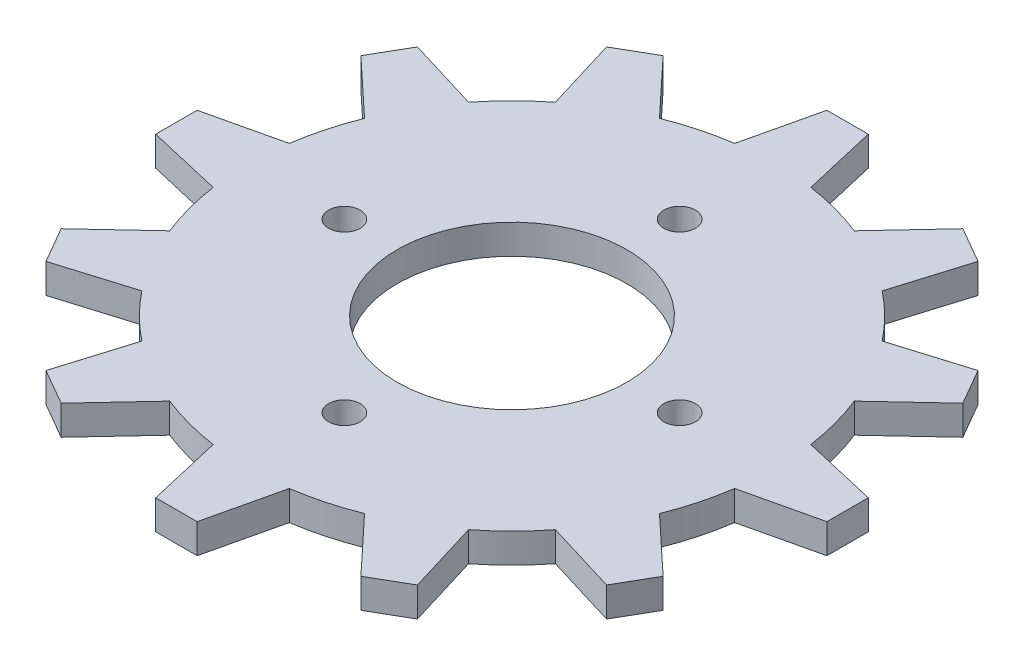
ISO-10303-21;
HEADER;
FILE_DESCRIPTION(('STEP AP214'),'2;1');
FILE_NAME('part.step','',(''),(''),'','','');
FILE_SCHEMA(('AUTOMOTIVE_DESIGN { 1 0 10303 214 1 1 1 1 }'));
ENDSEC;
DATA;
#1=APPLICATION_CONTEXT('core data for automotive mechanical design processes');
#2=APPLICATION_PROTOCOL_DEFINITION('international standard','automotive_design',2000,#1);
#3=PRODUCT_CONTEXT('',#1,'mechanical');
#4=PRODUCT('Part','Part','',(#3));
#5=PRODUCT_RELATED_PRODUCT_CATEGORY('part','',(#4));
#6=PRODUCT_DEFINITION_FORMATION('','',#4);
#7=PRODUCT_DEFINITION_CONTEXT('part definition',#1,'design');
#8=PRODUCT_DEFINITION('design','',#6,#7);
#9=PRODUCT_DEFINITION_SHAPE('','',#8);
#10=(LENGTH_UNIT() NAMED_UNIT(*) SI_UNIT(.MILLI.,.METRE.));
#11=(NAMED_UNIT(*) PLANE_ANGLE_UNIT() SI_UNIT($,.RADIAN.));
#12=(NAMED_UNIT(*) SI_UNIT($,.STERADIAN.) SOLID_ANGLE_UNIT());
#13=UNCERTAINTY_MEASURE_WITH_UNIT(LENGTH_MEASURE(1.E-05),#10,'distance_accuracy_value','');
#14=(GEOMETRIC_REPRESENTATION_CONTEXT(3) GLOBAL_UNCERTAINTY_ASSIGNED_CONTEXT((#13)) GLOBAL_UNIT_ASSIGNED_CONTEXT((#10,
#11,#12)) REPRESENTATION_CONTEXT('',''));
#15=CARTESIAN_POINT('',(0.,0.,0.));
#16=DIRECTION('',(0.,0.,1.));
#17=DIRECTION('',(1.,0.,0.));
#18=AXIS2_PLACEMENT_3D('',#15,#16,#17);
#19=CARTESIAN_POINT('',(0.,2.8,0.));
#20=DIRECTION('',(0.,-1.,0.));
#21=DIRECTION('',(0.,0.,-1.));
#22=AXIS2_PLACEMENT_3D('',#19,#20,#21);
#23=CYLINDRICAL_SURFACE('',#22,25.);
#24=CARTESIAN_POINT('',(0.,2.8,0.));
#25=DIRECTION('',(0.,1.,0.));
#26=DIRECTION('',(0.,0.,1.));
#27=AXIS2_PLACEMENT_3D('',#24,#25,#26);
#28=CIRCLE('',#27,25.);
#29=CARTESIAN_POINT('',(-23.2296720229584,2.8,-9.24025636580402));
#30=VERTEX_POINT('',#29);
#31=CARTESIAN_POINT('',(-24.7376142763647,2.8,-3.61253926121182));
#32=VERTEX_POINT('',#31);
#33=EDGE_CURVE('E44',#30,#32,#28,.T.);
#34=ORIENTED_EDGE('',*,*,#33,.F.);
#35=DIRECTION('',(0.,-1.,0.));
#36=VECTOR('',#35,1.);
#37=CARTESIAN_POINT('',(-23.2296720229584,2.8,-9.24025636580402));
#38=LINE('',#37,#36);
#39=CARTESIAN_POINT('',(-23.2296720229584,0.,-9.24025636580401));
#40=VERTEX_POINT('',#39);
#41=EDGE_CURVE('E375',#30,#40,#38,.T.);
#42=ORIENTED_EDGE('',*,*,#41,.T.);
#43=CARTESIAN_POINT('',(0.,0.,0.));
#44=DIRECTION('',(0.,1.,0.));
#45=DIRECTION('',(0.,0.,1.));
#46=AXIS2_PLACEMENT_3D('',#43,#44,#45);
#47=CIRCLE('',#46,25.);
#48=CARTESIAN_POINT('',(-24.7376142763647,0.,-3.61253926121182));
#49=VERTEX_POINT('',#48);
#50=EDGE_CURVE('E650',#40,#49,#47,.T.);
#51=ORIENTED_EDGE('',*,*,#50,.T.);
#52=DIRECTION('',(0.,-1.,0.));
#53=VECTOR('',#52,1.);
#54=CARTESIAN_POINT('',(-24.7376142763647,2.8,-3.61253926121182));
#55=LINE('',#54,#53);
#56=EDGE_CURVE('E643',#49,#32,#55,.F.);
#57=ORIENTED_EDGE('',*,*,#56,.T.);
#58=EDGE_LOOP('',(#34,#42,#51,#57));
#59=FACE_BOUND('',#58,.T.);
#60=ADVANCED_FACE('F33',(#59),#23,.T.);
#61=CARTESIAN_POINT('',(-15.4973579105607,0.,-19.6171327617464));
#62=VERTEX_POINT('',#61);
#63=CARTESIAN_POINT('',(-19.6171327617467,0.,-15.4973579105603));
#64=VERTEX_POINT('',#63);
#65=EDGE_CURVE('E736',#62,#64,#47,.T.);
#66=ORIENTED_EDGE('',*,*,#65,.T.);
#67=DIRECTION('',(0.,-1.,0.));
#68=VECTOR('',#67,1.);
#69=CARTESIAN_POINT('',(-19.6171327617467,2.8,-15.4973579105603));
#70=LINE('',#69,#68);
#71=CARTESIAN_POINT('',(-19.6171327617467,2.8,-15.4973579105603));
#72=VERTEX_POINT('',#71);
#73=EDGE_CURVE('E349',#64,#72,#70,.F.);
#74=ORIENTED_EDGE('',*,*,#73,.T.);
#75=CARTESIAN_POINT('',(-15.4973579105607,2.8,-19.6171327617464));
#76=VERTEX_POINT('',#75);
#77=EDGE_CURVE('E806',#76,#72,#28,.T.);
#78=ORIENTED_EDGE('',*,*,#77,.F.);
#79=DIRECTION('',(0.,-1.,0.));
#80=VECTOR('',#79,1.);
#81=CARTESIAN_POINT('',(-15.4973579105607,2.8,-19.6171327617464));
#82=LINE('',#81,#80);
#83=EDGE_CURVE('E398',#76,#62,#82,.T.);
#84=ORIENTED_EDGE('',*,*,#83,.T.);
#85=EDGE_LOOP('',(#66,#74,#78,#84));
#86=FACE_BOUND('',#85,.T.);
#87=ADVANCED_FACE('F687',(#86),#23,.T.);
#88=CARTESIAN_POINT('',(-3.61253926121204,0.,-24.7376142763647));
#89=VERTEX_POINT('',#88);
#90=CARTESIAN_POINT('',(-9.24025636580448,0.,-23.2296720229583));
#91=VERTEX_POINT('',#90);
#92=EDGE_CURVE('E737',#89,#91,#47,.T.);
#93=ORIENTED_EDGE('',*,*,#92,.T.);
#94=DIRECTION('',(0.,-1.,0.));
#95=VECTOR('',#94,1.);
#96=CARTESIAN_POINT('',(-9.24025636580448,2.8,-23.2296720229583));
#97=LINE('',#96,#95);
#98=CARTESIAN_POINT('',(-9.24025636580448,2.8,-23.2296720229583));
#99=VERTEX_POINT('',#98);
#100=EDGE_CURVE('E393',#91,#99,#97,.F.);
#101=ORIENTED_EDGE('',*,*,#100,.T.);
#102=CARTESIAN_POINT('',(-3.61253926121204,2.8,-24.7376142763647));
#103=VERTEX_POINT('',#102);
#104=EDGE_CURVE('E803',#103,#99,#28,.T.);
#105=ORIENTED_EDGE('',*,*,#104,.F.);
#106=DIRECTION('',(0.,-1.,0.));
#107=VECTOR('',#106,1.);
#108=CARTESIAN_POINT('',(-3.61253926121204,2.8,-24.7376142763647));
#109=LINE('',#108,#107);
#110=EDGE_CURVE('E423',#103,#89,#109,.T.);
#111=ORIENTED_EDGE('',*,*,#110,.T.);
#112=EDGE_LOOP('',(#93,#101,#105,#111));
#113=FACE_BOUND('',#112,.T.);
#114=ADVANCED_FACE('F692',(#113),#23,.T.);
#115=CARTESIAN_POINT('',(9.24025636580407,0.,-23.2296720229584));
#116=VERTEX_POINT('',#115);
#117=CARTESIAN_POINT('',(3.6125392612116,0.,-24.7376142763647));
#118=VERTEX_POINT('',#117);
#119=EDGE_CURVE('E739',#116,#118,#47,.T.);
#120=ORIENTED_EDGE('',*,*,#119,.T.);
#121=DIRECTION('',(0.,-1.,0.));
#122=VECTOR('',#121,1.);
#123=CARTESIAN_POINT('',(3.6125392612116,2.8,-24.7376142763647));
#124=LINE('',#123,#122);
#125=CARTESIAN_POINT('',(3.6125392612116,2.8,-24.7376142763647));
#126=VERTEX_POINT('',#125);
#127=EDGE_CURVE('E418',#118,#126,#124,.F.);
#128=ORIENTED_EDGE('',*,*,#127,.T.);
#129=CARTESIAN_POINT('',(9.24025636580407,2.8,-23.2296720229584));
#130=VERTEX_POINT('',#129);
#131=EDGE_CURVE('E800',#130,#126,#28,.T.);
#132=ORIENTED_EDGE('',*,*,#131,.F.);
#133=DIRECTION('',(0.,-1.,0.));
#134=VECTOR('',#133,1.);
#135=CARTESIAN_POINT('',(9.24025636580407,2.8,-23.2296720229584));
#136=LINE('',#135,#134);
#137=EDGE_CURVE('E448',#130,#116,#136,.T.);
#138=ORIENTED_EDGE('',*,*,#137,.T.);
#139=EDGE_LOOP('',(#120,#128,#132,#138));
#140=FACE_BOUND('',#139,.T.);
#141=ADVANCED_FACE('F926',(#140),#23,.T.);
#142=CARTESIAN_POINT('',(19.6171327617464,0.,-15.4973579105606));
#143=VERTEX_POINT('',#142);
#144=CARTESIAN_POINT('',(15.4973579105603,0.,-19.6171327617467));
#145=VERTEX_POINT('',#144);
#146=EDGE_CURVE('E743',#143,#145,#47,.T.);
#147=ORIENTED_EDGE('',*,*,#146,.T.);
#148=DIRECTION('',(0.,-1.,0.));
#149=VECTOR('',#148,1.);
#150=CARTESIAN_POINT('',(15.4973579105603,2.8,-19.6171327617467));
#151=LINE('',#150,#149);
#152=CARTESIAN_POINT('',(15.4973579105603,2.8,-19.6171327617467));
#153=VERTEX_POINT('',#152);
#154=EDGE_CURVE('E443',#145,#153,#151,.F.);
#155=ORIENTED_EDGE('',*,*,#154,.T.);
#156=CARTESIAN_POINT('',(19.6171327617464,2.8,-15.4973579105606));
#157=VERTEX_POINT('',#156);
#158=EDGE_CURVE('E797',#157,#153,#28,.T.);
#159=ORIENTED_EDGE('',*,*,#158,.F.);
#160=DIRECTION('',(0.,-1.,0.));
#161=VECTOR('',#160,1.);
#162=CARTESIAN_POINT('',(19.6171327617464,2.8,-15.4973579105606));
#163=LINE('',#162,#161);
#164=EDGE_CURVE('E473',#157,#143,#163,.T.);
#165=ORIENTED_EDGE('',*,*,#164,.T.);
#166=EDGE_LOOP('',(#147,#155,#159,#165));
#167=FACE_BOUND('',#166,.T.);
#168=ADVANCED_FACE('F922',(#167),#23,.T.);
#169=CARTESIAN_POINT('',(24.7376142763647,0.,-3.61253926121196));
#170=VERTEX_POINT('',#169);
#171=CARTESIAN_POINT('',(23.2296720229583,0.,-9.2402563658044));
#172=VERTEX_POINT('',#171);
#173=EDGE_CURVE('E747',#170,#172,#47,.T.);
#174=ORIENTED_EDGE('',*,*,#173,.T.);
#175=DIRECTION('',(0.,-1.,0.));
#176=VECTOR('',#175,1.);
#177=CARTESIAN_POINT('',(23.2296720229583,2.8,-9.2402563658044));
#178=LINE('',#177,#176);
#179=CARTESIAN_POINT('',(23.2296720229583,2.8,-9.2402563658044));
#180=VERTEX_POINT('',#179);
#181=EDGE_CURVE('E468',#172,#180,#178,.F.);
#182=ORIENTED_EDGE('',*,*,#181,.T.);
#183=CARTESIAN_POINT('',(24.7376142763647,2.8,-3.61253926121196));
#184=VERTEX_POINT('',#183);
#185=EDGE_CURVE('E794',#184,#180,#28,.T.);
#186=ORIENTED_EDGE('',*,*,#185,.F.);
#187=DIRECTION('',(0.,-1.,0.));
#188=VECTOR('',#187,1.);
#189=CARTESIAN_POINT('',(24.7376142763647,2.8,-3.61253926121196));
#190=LINE('',#189,#188);
#191=EDGE_CURVE('E498',#184,#170,#190,.T.);
#192=ORIENTED_EDGE('',*,*,#191,.T.);
#193=EDGE_LOOP('',(#174,#182,#186,#192));
#194=FACE_BOUND('',#193,.T.);
#195=ADVANCED_FACE('F918',(#194),#23,.T.);
#196=CARTESIAN_POINT('',(23.2296720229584,0.,9.24025636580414));
#197=VERTEX_POINT('',#196);
#198=CARTESIAN_POINT('',(24.7376142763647,0.,3.61253926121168));
#199=VERTEX_POINT('',#198);
#200=EDGE_CURVE('E751',#197,#199,#47,.T.);
#201=ORIENTED_EDGE('',*,*,#200,.T.);
#202=DIRECTION('',(0.,-1.,0.));
#203=VECTOR('',#202,1.);
#204=CARTESIAN_POINT('',(24.7376142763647,2.8,3.61253926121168));
#205=LINE('',#204,#203);
#206=CARTESIAN_POINT('',(24.7376142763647,2.8,3.61253926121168));
#207=VERTEX_POINT('',#206);
#208=EDGE_CURVE('E493',#199,#207,#205,.F.);
#209=ORIENTED_EDGE('',*,*,#208,.T.);
#210=CARTESIAN_POINT('',(23.2296720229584,2.8,9.24025636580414));
#211=VERTEX_POINT('',#210);
#212=EDGE_CURVE('E791',#211,#207,#28,.T.);
#213=ORIENTED_EDGE('',*,*,#212,.F.);
#214=DIRECTION('',(0.,-1.,0.));
#215=VECTOR('',#214,1.);
#216=CARTESIAN_POINT('',(23.2296720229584,2.8,9.24025636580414));
#217=LINE('',#216,#215);
#218=EDGE_CURVE('E523',#211,#197,#217,.T.);
#219=ORIENTED_EDGE('',*,*,#218,.T.);
#220=EDGE_LOOP('',(#201,#209,#213,#219));
#221=FACE_BOUND('',#220,.T.);
#222=ADVANCED_FACE('F914',(#221),#23,.T.);
#223=CARTESIAN_POINT('',(15.4973579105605,0.,19.6171327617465));
#224=VERTEX_POINT('',#223);
#225=CARTESIAN_POINT('',(19.6171327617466,0.,15.4973579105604));
#226=VERTEX_POINT('',#225);
#227=EDGE_CURVE('E755',#224,#226,#47,.T.);
#228=ORIENTED_EDGE('',*,*,#227,.T.);
#229=DIRECTION('',(0.,-1.,0.));
#230=VECTOR('',#229,1.);
#231=CARTESIAN_POINT('',(19.6171327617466,2.8,15.4973579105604));
#232=LINE('',#231,#230);
#233=CARTESIAN_POINT('',(19.6171327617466,2.8,15.4973579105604));
#234=VERTEX_POINT('',#233);
#235=EDGE_CURVE('E518',#226,#234,#232,.F.);
#236=ORIENTED_EDGE('',*,*,#235,.T.);
#237=CARTESIAN_POINT('',(15.4973579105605,2.8,19.6171327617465));
#238=VERTEX_POINT('',#237);
#239=EDGE_CURVE('E788',#238,#234,#28,.T.);
#240=ORIENTED_EDGE('',*,*,#239,.F.);
#241=DIRECTION('',(0.,-1.,0.));
#242=VECTOR('',#241,1.);
#243=CARTESIAN_POINT('',(15.4973579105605,2.8,19.6171327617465));
#244=LINE('',#243,#242);
#245=EDGE_CURVE('E548',#238,#224,#244,.T.);
#246=ORIENTED_EDGE('',*,*,#245,.T.);
#247=EDGE_LOOP('',(#228,#236,#240,#246));
#248=FACE_BOUND('',#247,.T.);
#249=ADVANCED_FACE('F910',(#248),#23,.T.);
#250=CARTESIAN_POINT('',(3.61253926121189,0.,24.7376142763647));
#251=VERTEX_POINT('',#250);
#252=CARTESIAN_POINT('',(9.24025636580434,0.,23.2296720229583));
#253=VERTEX_POINT('',#252);
#254=EDGE_CURVE('E759',#251,#253,#47,.T.);
#255=ORIENTED_EDGE('',*,*,#254,.T.);
#256=DIRECTION('',(0.,-1.,0.));
#257=VECTOR('',#256,1.);
#258=CARTESIAN_POINT('',(9.24025636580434,2.8,23.2296720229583));
#259=LINE('',#258,#257);
#260=CARTESIAN_POINT('',(9.24025636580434,2.8,23.2296720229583));
#261=VERTEX_POINT('',#260);
#262=EDGE_CURVE('E543',#253,#261,#259,.F.);
#263=ORIENTED_EDGE('',*,*,#262,.T.);
#264=CARTESIAN_POINT('',(3.61253926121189,2.8,24.7376142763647));
#265=VERTEX_POINT('',#264);
#266=EDGE_CURVE('E785',#265,#261,#28,.T.);
#267=ORIENTED_EDGE('',*,*,#266,.F.);
#268=DIRECTION('',(0.,-1.,0.));
#269=VECTOR('',#268,1.);
#270=CARTESIAN_POINT('',(3.61253926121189,2.8,24.7376142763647));
#271=LINE('',#270,#269);
#272=EDGE_CURVE('E573',#265,#251,#271,.T.);
#273=ORIENTED_EDGE('',*,*,#272,.T.);
#274=EDGE_LOOP('',(#255,#263,#267,#273));
#275=FACE_BOUND('',#274,.T.);
#276=ADVANCED_FACE('F906',(#275),#23,.T.);
#277=CARTESIAN_POINT('',(-9.24025636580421,0.,23.2296720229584));
#278=VERTEX_POINT('',#277);
#279=CARTESIAN_POINT('',(-3.61253926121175,0.,24.7376142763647));
#280=VERTEX_POINT('',#279);
#281=EDGE_CURVE('E763',#278,#280,#47,.T.);
#282=ORIENTED_EDGE('',*,*,#281,.T.);
#283=DIRECTION('',(0.,-1.,0.));
#284=VECTOR('',#283,1.);
#285=CARTESIAN_POINT('',(-3.61253926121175,2.8,24.7376142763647));
#286=LINE('',#285,#284);
#287=CARTESIAN_POINT('',(-3.61253926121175,2.8,24.7376142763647));
#288=VERTEX_POINT('',#287);
#289=EDGE_CURVE('E568',#280,#288,#286,.F.);
#290=ORIENTED_EDGE('',*,*,#289,.T.);
#291=CARTESIAN_POINT('',(-9.24025636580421,2.8,23.2296720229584));
#292=VERTEX_POINT('',#291);
#293=EDGE_CURVE('E784',#292,#288,#28,.T.);
#294=ORIENTED_EDGE('',*,*,#293,.F.);
#295=DIRECTION('',(0.,-1.,0.));
#296=VECTOR('',#295,1.);
#297=CARTESIAN_POINT('',(-9.24025636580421,2.8,23.2296720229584));
#298=LINE('',#297,#296);
#299=EDGE_CURVE('E598',#292,#278,#298,.T.);
#300=ORIENTED_EDGE('',*,*,#299,.T.);
#301=EDGE_LOOP('',(#282,#290,#294,#300));
#302=FACE_BOUND('',#301,.T.);
#303=ADVANCED_FACE('F705',(#302),#23,.T.);
#304=CARTESIAN_POINT('',(-19.6171327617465,0.,15.4973579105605));
#305=VERTEX_POINT('',#304);
#306=CARTESIAN_POINT('',(-15.4973579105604,0.,19.6171327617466));
#307=VERTEX_POINT('',#306);
#308=EDGE_CURVE('E655',#305,#307,#47,.T.);
#309=ORIENTED_EDGE('',*,*,#308,.T.);
#310=DIRECTION('',(0.,-1.,0.));
#311=VECTOR('',#310,1.);
#312=CARTESIAN_POINT('',(-15.4973579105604,2.8,19.6171327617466));
#313=LINE('',#312,#311);
#314=CARTESIAN_POINT('',(-15.4973579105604,2.8,19.6171327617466));
#315=VERTEX_POINT('',#314);
#316=EDGE_CURVE('E593',#307,#315,#313,.F.);
#317=ORIENTED_EDGE('',*,*,#316,.T.);
#318=CARTESIAN_POINT('',(-19.6171327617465,2.8,15.4973579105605));
#319=VERTEX_POINT('',#318);
#320=EDGE_CURVE('E42',#319,#315,#28,.T.);
#321=ORIENTED_EDGE('',*,*,#320,.F.);
#322=DIRECTION('',(0.,-1.,0.));
#323=VECTOR('',#322,1.);
#324=CARTESIAN_POINT('',(-19.6171327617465,2.8,15.4973579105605));
#325=LINE('',#324,#323);
#326=EDGE_CURVE('E623',#319,#305,#325,.T.);
#327=ORIENTED_EDGE('',*,*,#326,.T.);
#328=EDGE_LOOP('',(#309,#317,#321,#327));
#329=FACE_BOUND('',#328,.T.);
#330=ADVANCED_FACE('F697',(#329),#23,.T.);
#331=CARTESIAN_POINT('',(-24.7376142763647,0.,3.61253926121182));
#332=VERTEX_POINT('',#331);
#333=CARTESIAN_POINT('',(-23.2296720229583,0.,9.24025636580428));
#334=VERTEX_POINT('',#333);
#335=EDGE_CURVE('E652',#332,#334,#47,.T.);
#336=ORIENTED_EDGE('',*,*,#335,.T.);
#337=DIRECTION('',(0.,-1.,0.));
#338=VECTOR('',#337,1.);
#339=CARTESIAN_POINT('',(-23.2296720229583,2.8,9.24025636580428));
#340=LINE('',#339,#338);
#341=CARTESIAN_POINT('',(-23.2296720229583,2.8,9.24025636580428));
#342=VERTEX_POINT('',#341);
#343=EDGE_CURVE('E618',#334,#342,#340,.F.);
#344=ORIENTED_EDGE('',*,*,#343,.T.);
#345=CARTESIAN_POINT('',(-24.7376142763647,2.8,3.61253926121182));
#346=VERTEX_POINT('',#345);
#347=EDGE_CURVE('E11',#346,#342,#28,.T.);
#348=ORIENTED_EDGE('',*,*,#347,.F.);
#349=DIRECTION('',(0.,-1.,0.));
#350=VECTOR('',#349,1.);
#351=CARTESIAN_POINT('',(-24.7376142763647,2.8,3.61253926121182));
#352=LINE('',#351,#350);
#353=EDGE_CURVE('E648',#346,#332,#352,.T.);
#354=ORIENTED_EDGE('',*,*,#353,.T.);
#355=EDGE_LOOP('',(#336,#344,#348,#354));
#356=FACE_BOUND('',#355,.T.);
#357=ADVANCED_FACE('F35',(#356),#23,.T.);
#358=CARTESIAN_POINT('',(0.,2.8,0.));
#359=DIRECTION('',(0.,1.,0.));
#360=DIRECTION('',(0.,0.,1.));
#361=AXIS2_PLACEMENT_3D('',#358,#359,#360);
#362=PLANE('',#361);
#363=CARTESIAN_POINT('',(0.,2.8,15.9));
#364=DIRECTION('',(0.,1.,0.));
#365=DIRECTION('',(0.,0.,1.));
#366=AXIS2_PLACEMENT_3D('',#363,#364,#365);
#367=CIRCLE('',#366,1.5);
#368=CARTESIAN_POINT('',(0.,2.8,17.4));
#369=VERTEX_POINT('',#368);
#370=EDGE_CURVE('E1388',#369,#369,#367,.T.);
#371=ORIENTED_EDGE('',*,*,#370,.F.);
#372=EDGE_LOOP('',(#371));
#373=FACE_BOUND('',#372,.T.);
#374=CARTESIAN_POINT('',(-15.9,2.8,0.));
#375=DIRECTION('',(0.,1.,0.));
#376=DIRECTION('',(0.,0.,1.));
#377=AXIS2_PLACEMENT_3D('',#374,#375,#376);
#378=CIRCLE('',#377,1.5);
#379=CARTESIAN_POINT('',(-15.9,2.8,1.5));
#380=VERTEX_POINT('',#379);
#381=EDGE_CURVE('E1390',#380,#380,#378,.T.);
#382=ORIENTED_EDGE('',*,*,#381,.F.);
#383=EDGE_LOOP('',(#382));
#384=FACE_BOUND('',#383,.T.);
#385=CARTESIAN_POINT('',(0.,2.8,-15.9));
#386=DIRECTION('',(0.,1.,0.));
#387=DIRECTION('',(0.,0.,1.));
#388=AXIS2_PLACEMENT_3D('',#385,#386,#387);
#389=CIRCLE('',#388,1.5);
#390=CARTESIAN_POINT('',(0.,2.8,-14.4));
#391=VERTEX_POINT('',#390);
#392=EDGE_CURVE('E1394',#391,#391,#389,.T.);
#393=ORIENTED_EDGE('',*,*,#392,.F.);
#394=EDGE_LOOP('',(#393));
#395=FACE_BOUND('',#394,.T.);
#396=CARTESIAN_POINT('',(15.9,2.8,0.));
#397=DIRECTION('',(0.,1.,0.));
#398=DIRECTION('',(0.,0.,1.));
#399=AXIS2_PLACEMENT_3D('',#396,#397,#398);
#400=CIRCLE('',#399,1.5);
#401=CARTESIAN_POINT('',(15.9,2.8,1.5));
#402=VERTEX_POINT('',#401);
#403=EDGE_CURVE('E1396',#402,#402,#400,.T.);
#404=ORIENTED_EDGE('',*,*,#403,.F.);
#405=EDGE_LOOP('',(#404));
#406=FACE_BOUND('',#405,.T.);
#407=CARTESIAN_POINT('',(0.,2.8,0.));
#408=DIRECTION('',(0.,1.,0.));
#409=DIRECTION('',(0.,0.,1.));
#410=AXIS2_PLACEMENT_3D('',#407,#408,#409);
#411=CIRCLE('',#410,10.9);
#412=CARTESIAN_POINT('',(0.,2.8,10.9));
#413=VERTEX_POINT('',#412);
#414=EDGE_CURVE('E660',#413,#413,#411,.T.);
#415=ORIENTED_EDGE('',*,*,#414,.F.);
#416=EDGE_LOOP('',(#415));
#417=FACE_BOUND('',#416,.T.);
#418=ORIENTED_EDGE('',*,*,#77,.T.);
#419=DIRECTION('',(-0.956703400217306,0.,-0.29106460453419));
#420=VECTOR('',#419,1.);
#421=CARTESIAN_POINT('',(-17.9789802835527,2.8,-14.9989712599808));
#422=LINE('',#421,#420);
#423=CARTESIAN_POINT('',(-26.5893108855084,2.8,-17.6185527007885));
#424=VERTEX_POINT('',#423);
#425=EDGE_CURVE('E370',#72,#424,#422,.T.);
#426=ORIENTED_EDGE('',*,*,#425,.T.);
#427=DIRECTION('',(-0.499999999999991,0.,0.866025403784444));
#428=VECTOR('',#427,1.);
#429=CARTESIAN_POINT('',(-28.5527696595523,2.8,-14.2177423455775));
#430=LINE('',#429,#428);
#431=CARTESIAN_POINT('',(-28.5527696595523,2.8,-14.2177423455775));
#432=VERTEX_POINT('',#431);
#433=EDGE_CURVE('E360',#424,#432,#430,.T.);
#434=ORIENTED_EDGE('',*,*,#433,.T.);
#435=DIRECTION('',(0.730421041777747,0.,0.682997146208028));
#436=VECTOR('',#435,1.);
#437=CARTESIAN_POINT('',(-21.9789802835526,2.8,-8.07076802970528));
#438=LINE('',#437,#436);
#439=EDGE_CURVE('E51',#432,#30,#438,.T.);
#440=ORIENTED_EDGE('',*,*,#439,.T.);
#441=ORIENTED_EDGE('',*,*,#33,.T.);
#442=DIRECTION('',(-0.974061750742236,0.,0.226282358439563));
#443=VECTOR('',#442,1.);
#444=CARTESIAN_POINT('',(-23.0697392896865,2.8,-4.));
#445=LINE('',#444,#443);
#446=CARTESIAN_POINT('',(-31.8362950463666,2.8,-1.96345877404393));
#447=VERTEX_POINT('',#446);
#448=EDGE_CURVE('E637',#32,#447,#445,.T.);
#449=ORIENTED_EDGE('',*,*,#448,.T.);
#450=DIRECTION('',(0.,0.,1.));
#451=VECTOR('',#450,1.);
#452=CARTESIAN_POINT('',(-31.8362950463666,2.8,1.96345877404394));
#453=LINE('',#452,#451);
#454=CARTESIAN_POINT('',(-31.8362950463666,2.8,1.96345877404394));
#455=VERTEX_POINT('',#454);
#456=EDGE_CURVE('E630',#447,#455,#453,.T.);
#457=ORIENTED_EDGE('',*,*,#456,.T.);
#458=DIRECTION('',(0.974061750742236,0.,0.226282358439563));
#459=VECTOR('',#458,1.);
#460=CARTESIAN_POINT('',(-23.0697392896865,2.8,4.));
#461=LINE('',#460,#459);
#462=EDGE_CURVE('E626',#455,#346,#461,.T.);
#463=ORIENTED_EDGE('',*,*,#462,.T.);
#464=ORIENTED_EDGE('',*,*,#347,.T.);
#465=DIRECTION('',(-0.73042104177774,0.,0.682997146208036));
#466=VECTOR('',#465,1.);
#467=CARTESIAN_POINT('',(-21.9789802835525,2.8,8.07076802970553));
#468=LINE('',#467,#466);
#469=CARTESIAN_POINT('',(-28.5527696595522,2.8,14.2177423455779));
#470=VERTEX_POINT('',#469);
#471=EDGE_CURVE('E612',#342,#470,#468,.T.);
#472=ORIENTED_EDGE('',*,*,#471,.T.);
#473=DIRECTION('',(0.500000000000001,0.,0.866025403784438));
#474=VECTOR('',#473,1.);
#475=CARTESIAN_POINT('',(-26.5893108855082,2.8,17.6185527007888));
#476=LINE('',#475,#474);
#477=CARTESIAN_POINT('',(-26.5893108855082,2.8,17.6185527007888));
#478=VERTEX_POINT('',#477);
#479=EDGE_CURVE('E605',#470,#478,#476,.T.);
#480=ORIENTED_EDGE('',*,*,#479,.T.);
#481=DIRECTION('',(0.956703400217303,0.,-0.291064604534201));
#482=VECTOR('',#481,1.);
#483=CARTESIAN_POINT('',(-17.9789802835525,2.8,14.998971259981));
#484=LINE('',#483,#482);
#485=EDGE_CURVE('E601',#478,#319,#484,.T.);
#486=ORIENTED_EDGE('',*,*,#485,.T.);
#487=ORIENTED_EDGE('',*,*,#320,.T.);
#488=DIRECTION('',(-0.291064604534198,0.,0.956703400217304));
#489=VECTOR('',#488,1.);
#490=CARTESIAN_POINT('',(-14.998971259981,2.8,17.9789802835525));
#491=LINE('',#490,#489);
#492=CARTESIAN_POINT('',(-17.6185527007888,2.8,26.5893108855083));
#493=VERTEX_POINT('',#492);
#494=EDGE_CURVE('E587',#315,#493,#491,.T.);
#495=ORIENTED_EDGE('',*,*,#494,.T.);
#496=DIRECTION('',(0.86602540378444,0.,0.499999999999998));
#497=VECTOR('',#496,1.);
#498=CARTESIAN_POINT('',(-14.2177423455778,2.8,28.5527696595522));
#499=LINE('',#498,#497);
#500=CARTESIAN_POINT('',(-14.2177423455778,2.8,28.5527696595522));
#501=VERTEX_POINT('',#500);
#502=EDGE_CURVE('E580',#493,#501,#499,.T.);
#503=ORIENTED_EDGE('',*,*,#502,.T.);
#504=DIRECTION('',(0.682997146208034,0.,-0.730421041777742));
#505=VECTOR('',#504,1.);
#506=CARTESIAN_POINT('',(-8.07076802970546,2.8,21.9789802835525));
#507=LINE('',#506,#505);
#508=EDGE_CURVE('E576',#501,#292,#507,.T.);
#509=ORIENTED_EDGE('',*,*,#508,.T.);
#510=ORIENTED_EDGE('',*,*,#293,.T.);
#511=DIRECTION('',(0.226282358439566,0.,0.974061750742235));
#512=VECTOR('',#511,1.);
#513=CARTESIAN_POINT('',(-3.99999999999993,2.8,23.0697392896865));
#514=LINE('',#513,#512);
#515=CARTESIAN_POINT('',(-1.96345877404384,2.8,31.8362950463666));
#516=VERTEX_POINT('',#515);
#517=EDGE_CURVE('E562',#288,#516,#514,.T.);
#518=ORIENTED_EDGE('',*,*,#517,.T.);
#519=DIRECTION('',(1.,0.,0.));
#520=VECTOR('',#519,1.);
#521=CARTESIAN_POINT('',(1.96345877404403,2.8,31.8362950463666));
#522=LINE('',#521,#520);
#523=CARTESIAN_POINT('',(1.96345877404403,2.8,31.8362950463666));
#524=VERTEX_POINT('',#523);
#525=EDGE_CURVE('E555',#516,#524,#522,.T.);
#526=ORIENTED_EDGE('',*,*,#525,.T.);
#527=DIRECTION('',(0.22628235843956,0.,-0.974061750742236));
#528=VECTOR('',#527,1.);
#529=CARTESIAN_POINT('',(4.00000000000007,2.8,23.0697392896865));
#530=LINE('',#529,#528);
#531=EDGE_CURVE('E551',#524,#265,#530,.T.);
#532=ORIENTED_EDGE('',*,*,#531,.T.);
#533=ORIENTED_EDGE('',*,*,#266,.T.);
#534=DIRECTION('',(0.682997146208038,0.,0.730421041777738));
#535=VECTOR('',#534,1.);
#536=CARTESIAN_POINT('',(8.07076802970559,2.8,21.9789802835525));
#537=LINE('',#536,#535);
#538=CARTESIAN_POINT('',(14.2177423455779,2.8,28.5527696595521));
#539=VERTEX_POINT('',#538);
#540=EDGE_CURVE('E537',#261,#539,#537,.T.);
#541=ORIENTED_EDGE('',*,*,#540,.T.);
#542=DIRECTION('',(0.866025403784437,0.,-0.500000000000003));
#543=VECTOR('',#542,1.);
#544=CARTESIAN_POINT('',(17.6185527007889,2.8,26.5893108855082));
#545=LINE('',#544,#543);
#546=CARTESIAN_POINT('',(17.6185527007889,2.8,26.5893108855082));
#547=VERTEX_POINT('',#546);
#548=EDGE_CURVE('E530',#539,#547,#545,.T.);
#549=ORIENTED_EDGE('',*,*,#548,.T.);
#550=DIRECTION('',(-0.291064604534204,0.,-0.956703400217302));
#551=VECTOR('',#550,1.);
#552=CARTESIAN_POINT('',(14.9989712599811,2.8,17.9789802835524));
#553=LINE('',#552,#551);
#554=EDGE_CURVE('E526',#547,#238,#553,.T.);
#555=ORIENTED_EDGE('',*,*,#554,.T.);
#556=ORIENTED_EDGE('',*,*,#239,.T.);
#557=DIRECTION('',(0.956703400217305,0.,0.291064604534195));
#558=VECTOR('',#557,1.);
#559=CARTESIAN_POINT('',(17.9789802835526,2.8,14.9989712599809));
#560=LINE('',#559,#558);
#561=CARTESIAN_POINT('',(26.5893108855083,2.8,17.6185527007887));
#562=VERTEX_POINT('',#561);
#563=EDGE_CURVE('E512',#234,#562,#560,.T.);
#564=ORIENTED_EDGE('',*,*,#563,.T.);
#565=DIRECTION('',(0.499999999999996,0.,-0.866025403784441));
#566=VECTOR('',#565,1.);
#567=CARTESIAN_POINT('',(28.5527696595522,2.8,14.2177423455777));
#568=LINE('',#567,#566);
#569=CARTESIAN_POINT('',(28.5527696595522,2.8,14.2177423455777));
#570=VERTEX_POINT('',#569);
#571=EDGE_CURVE('E505',#562,#570,#568,.T.);
#572=ORIENTED_EDGE('',*,*,#571,.T.);
#573=DIRECTION('',(-0.730421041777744,0.,-0.682997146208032));
#574=VECTOR('',#573,1.);
#575=CARTESIAN_POINT('',(21.9789802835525,2.8,8.07076802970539));
#576=LINE('',#575,#574);
#577=EDGE_CURVE('E501',#570,#211,#576,.T.);
#578=ORIENTED_EDGE('',*,*,#577,.T.);
#579=ORIENTED_EDGE('',*,*,#212,.T.);
#580=DIRECTION('',(0.974061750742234,0.,-0.226282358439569));
#581=VECTOR('',#580,1.);
#582=CARTESIAN_POINT('',(23.0697392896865,2.8,3.99999999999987));
#583=LINE('',#582,#581);
#584=CARTESIAN_POINT('',(31.8362950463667,2.8,1.96345877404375));
#585=VERTEX_POINT('',#584);
#586=EDGE_CURVE('E487',#207,#585,#583,.T.);
#587=ORIENTED_EDGE('',*,*,#586,.T.);
#588=DIRECTION('',(0.,0.,-1.));
#589=VECTOR('',#588,1.);
#590=CARTESIAN_POINT('',(31.8362950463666,2.8,-1.96345877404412));
#591=LINE('',#590,#589);
#592=CARTESIAN_POINT('',(31.8362950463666,2.8,-1.96345877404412));
#593=VERTEX_POINT('',#592);
#594=EDGE_CURVE('E480',#585,#593,#591,.T.);
#595=ORIENTED_EDGE('',*,*,#594,.T.);
#596=DIRECTION('',(-0.974061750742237,0.,-0.226282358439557));
#597=VECTOR('',#596,1.);
#598=CARTESIAN_POINT('',(23.0697392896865,2.8,-4.00000000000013));
#599=LINE('',#598,#597);
#600=EDGE_CURVE('E476',#593,#184,#599,.T.);
#601=ORIENTED_EDGE('',*,*,#600,.T.);
#602=ORIENTED_EDGE('',*,*,#185,.T.);
#603=DIRECTION('',(0.730421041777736,0.,-0.68299714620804));
#604=VECTOR('',#603,1.);
#605=CARTESIAN_POINT('',(21.9789802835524,2.8,-8.07076802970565));
#606=LINE('',#605,#604);
#607=CARTESIAN_POINT('',(28.5527696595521,2.8,-14.217742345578));
#608=VERTEX_POINT('',#607);
#609=EDGE_CURVE('E462',#180,#608,#606,.T.);
#610=ORIENTED_EDGE('',*,*,#609,.T.);
#611=DIRECTION('',(-0.500000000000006,0.,-0.866025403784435));
#612=VECTOR('',#611,1.);
#613=CARTESIAN_POINT('',(26.5893108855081,2.8,-17.618552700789));
#614=LINE('',#613,#612);
#615=CARTESIAN_POINT('',(26.5893108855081,2.8,-17.618552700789));
#616=VERTEX_POINT('',#615);
#617=EDGE_CURVE('E455',#608,#616,#614,.T.);
#618=ORIENTED_EDGE('',*,*,#617,.T.);
#619=DIRECTION('',(-0.956703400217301,0.,0.291064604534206));
#620=VECTOR('',#619,1.);
#621=CARTESIAN_POINT('',(17.9789802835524,2.8,-14.9989712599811));
#622=LINE('',#621,#620);
#623=EDGE_CURVE('E451',#616,#157,#622,.T.);
#624=ORIENTED_EDGE('',*,*,#623,.T.);
#625=ORIENTED_EDGE('',*,*,#158,.T.);
#626=DIRECTION('',(0.291064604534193,0.,-0.956703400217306));
#627=VECTOR('',#626,1.);
#628=CARTESIAN_POINT('',(14.9989712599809,2.8,-17.9789802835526));
#629=LINE('',#628,#627);
#630=CARTESIAN_POINT('',(17.6185527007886,2.8,-26.5893108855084));
#631=VERTEX_POINT('',#630);
#632=EDGE_CURVE('E437',#153,#631,#629,.T.);
#633=ORIENTED_EDGE('',*,*,#632,.T.);
#634=DIRECTION('',(-0.866025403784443,0.,-0.499999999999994));
#635=VECTOR('',#634,1.);
#636=CARTESIAN_POINT('',(14.2177423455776,2.8,-28.5527696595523));
#637=LINE('',#636,#635);
#638=CARTESIAN_POINT('',(14.2177423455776,2.8,-28.5527696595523));
#639=VERTEX_POINT('',#638);
#640=EDGE_CURVE('E430',#631,#639,#637,.T.);
#641=ORIENTED_EDGE('',*,*,#640,.T.);
#642=DIRECTION('',(-0.68299714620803,0.,0.730421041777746));
#643=VECTOR('',#642,1.);
#644=CARTESIAN_POINT('',(8.07076802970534,2.8,-21.9789802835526));
#645=LINE('',#644,#643);
#646=EDGE_CURVE('E426',#639,#130,#645,.T.);
#647=ORIENTED_EDGE('',*,*,#646,.T.);
#648=ORIENTED_EDGE('',*,*,#131,.T.);
#649=DIRECTION('',(-0.226282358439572,0.,-0.974061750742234));
#650=VECTOR('',#649,1.);
#651=CARTESIAN_POINT('',(3.9999999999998,2.8,-23.0697392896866));
#652=LINE('',#651,#650);
#653=CARTESIAN_POINT('',(1.96345877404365,2.8,-31.8362950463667));
#654=VERTEX_POINT('',#653);
#655=EDGE_CURVE('E412',#126,#654,#652,.T.);
#656=ORIENTED_EDGE('',*,*,#655,.T.);
#657=DIRECTION('',(-1.,0.,0.));
#658=VECTOR('',#657,1.);
#659=CARTESIAN_POINT('',(-1.96345877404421,2.8,-31.8362950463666));
#660=LINE('',#659,#658);
#661=CARTESIAN_POINT('',(-1.96345877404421,2.8,-31.8362950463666));
#662=VERTEX_POINT('',#661);
#663=EDGE_CURVE('E405',#654,#662,#660,.T.);
#664=ORIENTED_EDGE('',*,*,#663,.T.);
#665=DIRECTION('',(-0.226282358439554,0.,0.974061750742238));
#666=VECTOR('',#665,1.);
#667=CARTESIAN_POINT('',(-4.0000000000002,2.8,-23.0697392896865));
#668=LINE('',#667,#666);
#669=EDGE_CURVE('E401',#662,#103,#668,.T.);
#670=ORIENTED_EDGE('',*,*,#669,.T.);
#671=ORIENTED_EDGE('',*,*,#104,.T.);
#672=DIRECTION('',(-0.682997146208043,0.,-0.730421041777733));
#673=VECTOR('',#672,1.);
#674=CARTESIAN_POINT('',(-8.07076802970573,2.8,-21.9789802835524));
#675=LINE('',#674,#673);
#676=CARTESIAN_POINT('',(-14.2177423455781,2.8,-28.552769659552));
#677=VERTEX_POINT('',#676);
#678=EDGE_CURVE('E388',#99,#677,#675,.T.);
#679=ORIENTED_EDGE('',*,*,#678,.T.);
#680=DIRECTION('',(-0.866025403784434,0.,0.500000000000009));
#681=VECTOR('',#680,1.);
#682=CARTESIAN_POINT('',(-17.6185527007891,2.8,-26.5893108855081));
#683=LINE('',#682,#681);
#684=CARTESIAN_POINT('',(-17.6185527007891,2.8,-26.5893108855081));
#685=VERTEX_POINT('',#684);
#686=EDGE_CURVE('E381',#677,#685,#683,.T.);
#687=ORIENTED_EDGE('',*,*,#686,.T.);
#688=DIRECTION('',(0.29106460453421,0.,0.9567034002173));
#689=VECTOR('',#688,1.);
#690=CARTESIAN_POINT('',(-14.9989712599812,2.8,-17.9789802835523));
#691=LINE('',#690,#689);
#692=EDGE_CURVE('E58',#685,#76,#691,.T.);
#693=ORIENTED_EDGE('',*,*,#692,.T.);
#694=EDGE_LOOP('',(#418,#426,#434,#440,#441,#449,#457,#463,#464,#472,#480,#486,#487,#495,#503,
#509,#510,#518,#526,#532,#533,#541,#549,#555,#556,#564,#572,#578,#579,#587,#595,#601,#602,#610,
#618,#624,#625,#633,#641,#647,#648,#656,#664,#670,#671,#679,#687,#693));
#695=FACE_BOUND('',#694,.T.);
#696=ADVANCED_FACE('F696',(#373,#384,#395,#406,#417,#695),#362,.T.);
#697=CARTESIAN_POINT('',(0.,0.,0.));
#698=DIRECTION('',(0.,1.,0.));
#699=DIRECTION('',(0.,0.,1.));
#700=AXIS2_PLACEMENT_3D('',#697,#698,#699);
#701=PLANE('',#700);
#702=CARTESIAN_POINT('',(0.,0.,15.9));
#703=DIRECTION('',(0.,1.,0.));
#704=DIRECTION('',(0.,0.,1.));
#705=AXIS2_PLACEMENT_3D('',#702,#703,#704);
#706=CIRCLE('',#705,1.5);
#707=CARTESIAN_POINT('',(0.,0.,17.4));
#708=VERTEX_POINT('',#707);
#709=EDGE_CURVE('E37',#708,#708,#706,.T.);
#710=ORIENTED_EDGE('',*,*,#709,.T.);
#711=EDGE_LOOP('',(#710));
#712=FACE_BOUND('',#711,.T.);
#713=CARTESIAN_POINT('',(-15.9,0.,0.));
#714=DIRECTION('',(0.,1.,0.));
#715=DIRECTION('',(0.,0.,1.));
#716=AXIS2_PLACEMENT_3D('',#713,#714,#715);
#717=CIRCLE('',#716,1.5);
#718=CARTESIAN_POINT('',(-15.9,0.,1.5));
#719=VERTEX_POINT('',#718);
#720=EDGE_CURVE('E665',#719,#719,#717,.T.);
#721=ORIENTED_EDGE('',*,*,#720,.T.);
#722=EDGE_LOOP('',(#721));
#723=FACE_BOUND('',#722,.T.);
#724=CARTESIAN_POINT('',(0.,0.,-15.9));
#725=DIRECTION('',(0.,1.,0.));
#726=DIRECTION('',(0.,0.,1.));
#727=AXIS2_PLACEMENT_3D('',#724,#725,#726);
#728=CIRCLE('',#727,1.5);
#729=CARTESIAN_POINT('',(0.,0.,-14.4));
#730=VERTEX_POINT('',#729);
#731=EDGE_CURVE('E663',#730,#730,#728,.T.);
#732=ORIENTED_EDGE('',*,*,#731,.T.);
#733=EDGE_LOOP('',(#732));
#734=FACE_BOUND('',#733,.T.);
#735=CARTESIAN_POINT('',(15.9,0.,0.));
#736=DIRECTION('',(0.,1.,0.));
#737=DIRECTION('',(0.,0.,1.));
#738=AXIS2_PLACEMENT_3D('',#735,#736,#737);
#739=CIRCLE('',#738,1.5);
#740=CARTESIAN_POINT('',(15.9,0.,1.5));
#741=VERTEX_POINT('',#740);
#742=EDGE_CURVE('E659',#741,#741,#739,.T.);
#743=ORIENTED_EDGE('',*,*,#742,.T.);
#744=EDGE_LOOP('',(#743));
#745=FACE_BOUND('',#744,.T.);
#746=CARTESIAN_POINT('',(0.,0.,0.));
#747=DIRECTION('',(0.,1.,0.));
#748=DIRECTION('',(0.,0.,1.));
#749=AXIS2_PLACEMENT_3D('',#746,#747,#748);
#750=CIRCLE('',#749,10.9);
#751=CARTESIAN_POINT('',(0.,0.,10.9));
#752=VERTEX_POINT('',#751);
#753=EDGE_CURVE('E656',#752,#752,#750,.T.);
#754=ORIENTED_EDGE('',*,*,#753,.T.);
#755=EDGE_LOOP('',(#754));
#756=FACE_BOUND('',#755,.T.);
#757=ORIENTED_EDGE('',*,*,#50,.F.);
#758=DIRECTION('',(0.730421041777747,0.,0.682997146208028));
#759=VECTOR('',#758,1.);
#760=CARTESIAN_POINT('',(-21.9789802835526,0.,-8.07076802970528));
#761=LINE('',#760,#759);
#762=CARTESIAN_POINT('',(-28.5527696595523,0.,-14.2177423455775));
#763=VERTEX_POINT('',#762);
#764=EDGE_CURVE('E355',#763,#40,#761,.T.);
#765=ORIENTED_EDGE('',*,*,#764,.F.);
#766=DIRECTION('',(-0.499999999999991,0.,0.866025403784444));
#767=VECTOR('',#766,1.);
#768=CARTESIAN_POINT('',(-28.5527696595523,0.,-14.2177423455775));
#769=LINE('',#768,#767);
#770=CARTESIAN_POINT('',(-26.5893108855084,0.,-17.6185527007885));
#771=VERTEX_POINT('',#770);
#772=EDGE_CURVE('E354',#771,#763,#769,.T.);
#773=ORIENTED_EDGE('',*,*,#772,.F.);
#774=DIRECTION('',(-0.956703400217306,0.,-0.29106460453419));
#775=VECTOR('',#774,1.);
#776=CARTESIAN_POINT('',(-17.9789802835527,0.,-14.9989712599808));
#777=LINE('',#776,#775);
#778=EDGE_CURVE('E343',#64,#771,#777,.T.);
#779=ORIENTED_EDGE('',*,*,#778,.F.);
#780=ORIENTED_EDGE('',*,*,#65,.F.);
#781=DIRECTION('',(0.29106460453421,0.,0.9567034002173));
#782=VECTOR('',#781,1.);
#783=CARTESIAN_POINT('',(-14.9989712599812,0.,-17.9789802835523));
#784=LINE('',#783,#782);
#785=CARTESIAN_POINT('',(-17.6185527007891,0.,-26.5893108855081));
#786=VERTEX_POINT('',#785);
#787=EDGE_CURVE('E378',#786,#62,#784,.T.);
#788=ORIENTED_EDGE('',*,*,#787,.F.);
#789=DIRECTION('',(-0.866025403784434,0.,0.500000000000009));
#790=VECTOR('',#789,1.);
#791=CARTESIAN_POINT('',(-17.6185527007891,0.,-26.5893108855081));
#792=LINE('',#791,#790);
#793=CARTESIAN_POINT('',(-14.2177423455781,0.,-28.552769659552));
#794=VERTEX_POINT('',#793);
#795=EDGE_CURVE('E383',#794,#786,#792,.T.);
#796=ORIENTED_EDGE('',*,*,#795,.F.);
#797=DIRECTION('',(-0.682997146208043,0.,-0.730421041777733));
#798=VECTOR('',#797,1.);
#799=CARTESIAN_POINT('',(-8.07076802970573,0.,-21.9789802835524));
#800=LINE('',#799,#798);
#801=EDGE_CURVE('E380',#91,#794,#800,.T.);
#802=ORIENTED_EDGE('',*,*,#801,.F.);
#803=ORIENTED_EDGE('',*,*,#92,.F.);
#804=DIRECTION('',(-0.226282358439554,0.,0.974061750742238));
#805=VECTOR('',#804,1.);
#806=CARTESIAN_POINT('',(-4.0000000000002,0.,-23.0697392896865));
#807=LINE('',#806,#805);
#808=CARTESIAN_POINT('',(-1.96345877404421,0.,-31.8362950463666));
#809=VERTEX_POINT('',#808);
#810=EDGE_CURVE('E402',#809,#89,#807,.T.);
#811=ORIENTED_EDGE('',*,*,#810,.F.);
#812=DIRECTION('',(-1.,0.,0.));
#813=VECTOR('',#812,1.);
#814=CARTESIAN_POINT('',(-1.96345877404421,0.,-31.8362950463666));
#815=LINE('',#814,#813);
#816=CARTESIAN_POINT('',(1.96345877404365,0.,-31.8362950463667));
#817=VERTEX_POINT('',#816);
#818=EDGE_CURVE('E407',#817,#809,#815,.T.);
#819=ORIENTED_EDGE('',*,*,#818,.F.);
#820=DIRECTION('',(-0.226282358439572,0.,-0.974061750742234));
#821=VECTOR('',#820,1.);
#822=CARTESIAN_POINT('',(3.9999999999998,0.,-23.0697392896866));
#823=LINE('',#822,#821);
#824=EDGE_CURVE('E404',#118,#817,#823,.T.);
#825=ORIENTED_EDGE('',*,*,#824,.F.);
#826=ORIENTED_EDGE('',*,*,#119,.F.);
#827=DIRECTION('',(-0.68299714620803,0.,0.730421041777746));
#828=VECTOR('',#827,1.);
#829=CARTESIAN_POINT('',(8.07076802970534,0.,-21.9789802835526));
#830=LINE('',#829,#828);
#831=CARTESIAN_POINT('',(14.2177423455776,0.,-28.5527696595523));
#832=VERTEX_POINT('',#831);
#833=EDGE_CURVE('E427',#832,#116,#830,.T.);
#834=ORIENTED_EDGE('',*,*,#833,.F.);
#835=DIRECTION('',(-0.866025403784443,0.,-0.499999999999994));
#836=VECTOR('',#835,1.);
#837=CARTESIAN_POINT('',(14.2177423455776,0.,-28.5527696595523));
#838=LINE('',#837,#836);
#839=CARTESIAN_POINT('',(17.6185527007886,0.,-26.5893108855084));
#840=VERTEX_POINT('',#839);
#841=EDGE_CURVE('E432',#840,#832,#838,.T.);
#842=ORIENTED_EDGE('',*,*,#841,.F.);
#843=DIRECTION('',(0.291064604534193,0.,-0.956703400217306));
#844=VECTOR('',#843,1.);
#845=CARTESIAN_POINT('',(14.9989712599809,0.,-17.9789802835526));
#846=LINE('',#845,#844);
#847=EDGE_CURVE('E429',#145,#840,#846,.T.);
#848=ORIENTED_EDGE('',*,*,#847,.F.);
#849=ORIENTED_EDGE('',*,*,#146,.F.);
#850=DIRECTION('',(-0.956703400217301,0.,0.291064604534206));
#851=VECTOR('',#850,1.);
#852=CARTESIAN_POINT('',(17.9789802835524,0.,-14.9989712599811));
#853=LINE('',#852,#851);
#854=CARTESIAN_POINT('',(26.5893108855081,0.,-17.618552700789));
#855=VERTEX_POINT('',#854);
#856=EDGE_CURVE('E452',#855,#143,#853,.T.);
#857=ORIENTED_EDGE('',*,*,#856,.F.);
#858=DIRECTION('',(-0.500000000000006,0.,-0.866025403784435));
#859=VECTOR('',#858,1.);
#860=CARTESIAN_POINT('',(26.5893108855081,0.,-17.618552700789));
#861=LINE('',#860,#859);
#862=CARTESIAN_POINT('',(28.5527696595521,0.,-14.217742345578));
#863=VERTEX_POINT('',#862);
#864=EDGE_CURVE('E457',#863,#855,#861,.T.);
#865=ORIENTED_EDGE('',*,*,#864,.F.);
#866=DIRECTION('',(0.730421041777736,0.,-0.68299714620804));
#867=VECTOR('',#866,1.);
#868=CARTESIAN_POINT('',(21.9789802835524,0.,-8.07076802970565));
#869=LINE('',#868,#867);
#870=EDGE_CURVE('E454',#172,#863,#869,.T.);
#871=ORIENTED_EDGE('',*,*,#870,.F.);
#872=ORIENTED_EDGE('',*,*,#173,.F.);
#873=DIRECTION('',(-0.974061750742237,0.,-0.226282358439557));
#874=VECTOR('',#873,1.);
#875=CARTESIAN_POINT('',(23.0697392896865,0.,-4.00000000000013));
#876=LINE('',#875,#874);
#877=CARTESIAN_POINT('',(31.8362950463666,0.,-1.96345877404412));
#878=VERTEX_POINT('',#877);
#879=EDGE_CURVE('E477',#878,#170,#876,.T.);
#880=ORIENTED_EDGE('',*,*,#879,.F.);
#881=DIRECTION('',(0.,0.,-1.));
#882=VECTOR('',#881,1.);
#883=CARTESIAN_POINT('',(31.8362950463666,0.,-1.96345877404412));
#884=LINE('',#883,#882);
#885=CARTESIAN_POINT('',(31.8362950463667,0.,1.96345877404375));
#886=VERTEX_POINT('',#885);
#887=EDGE_CURVE('E482',#886,#878,#884,.T.);
#888=ORIENTED_EDGE('',*,*,#887,.F.);
#889=DIRECTION('',(0.974061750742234,0.,-0.226282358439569));
#890=VECTOR('',#889,1.);
#891=CARTESIAN_POINT('',(23.0697392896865,0.,3.99999999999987));
#892=LINE('',#891,#890);
#893=EDGE_CURVE('E479',#199,#886,#892,.T.);
#894=ORIENTED_EDGE('',*,*,#893,.F.);
#895=ORIENTED_EDGE('',*,*,#200,.F.);
#896=DIRECTION('',(-0.730421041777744,0.,-0.682997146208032));
#897=VECTOR('',#896,1.);
#898=CARTESIAN_POINT('',(21.9789802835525,0.,8.07076802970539));
#899=LINE('',#898,#897);
#900=CARTESIAN_POINT('',(28.5527696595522,0.,14.2177423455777));
#901=VERTEX_POINT('',#900);
#902=EDGE_CURVE('E502',#901,#197,#899,.T.);
#903=ORIENTED_EDGE('',*,*,#902,.F.);
#904=DIRECTION('',(0.499999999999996,0.,-0.866025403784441));
#905=VECTOR('',#904,1.);
#906=CARTESIAN_POINT('',(28.5527696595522,0.,14.2177423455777));
#907=LINE('',#906,#905);
#908=CARTESIAN_POINT('',(26.5893108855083,0.,17.6185527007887));
#909=VERTEX_POINT('',#908);
#910=EDGE_CURVE('E507',#909,#901,#907,.T.);
#911=ORIENTED_EDGE('',*,*,#910,.F.);
#912=DIRECTION('',(0.956703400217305,0.,0.291064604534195));
#913=VECTOR('',#912,1.);
#914=CARTESIAN_POINT('',(17.9789802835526,0.,14.9989712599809));
#915=LINE('',#914,#913);
#916=EDGE_CURVE('E504',#226,#909,#915,.T.);
#917=ORIENTED_EDGE('',*,*,#916,.F.);
#918=ORIENTED_EDGE('',*,*,#227,.F.);
#919=DIRECTION('',(-0.291064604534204,0.,-0.956703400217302));
#920=VECTOR('',#919,1.);
#921=CARTESIAN_POINT('',(14.9989712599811,0.,17.9789802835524));
#922=LINE('',#921,#920);
#923=CARTESIAN_POINT('',(17.6185527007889,0.,26.5893108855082));
#924=VERTEX_POINT('',#923);
#925=EDGE_CURVE('E527',#924,#224,#922,.T.);
#926=ORIENTED_EDGE('',*,*,#925,.F.);
#927=DIRECTION('',(0.866025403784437,0.,-0.500000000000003));
#928=VECTOR('',#927,1.);
#929=CARTESIAN_POINT('',(17.6185527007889,0.,26.5893108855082));
#930=LINE('',#929,#928);
#931=CARTESIAN_POINT('',(14.2177423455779,0.,28.5527696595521));
#932=VERTEX_POINT('',#931);
#933=EDGE_CURVE('E532',#932,#924,#930,.T.);
#934=ORIENTED_EDGE('',*,*,#933,.F.);
#935=DIRECTION('',(0.682997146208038,0.,0.730421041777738));
#936=VECTOR('',#935,1.);
#937=CARTESIAN_POINT('',(8.07076802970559,0.,21.9789802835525));
#938=LINE('',#937,#936);
#939=EDGE_CURVE('E529',#253,#932,#938,.T.);
#940=ORIENTED_EDGE('',*,*,#939,.F.);
#941=ORIENTED_EDGE('',*,*,#254,.F.);
#942=DIRECTION('',(0.22628235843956,0.,-0.974061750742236));
#943=VECTOR('',#942,1.);
#944=CARTESIAN_POINT('',(4.00000000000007,0.,23.0697392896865));
#945=LINE('',#944,#943);
#946=CARTESIAN_POINT('',(1.96345877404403,0.,31.8362950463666));
#947=VERTEX_POINT('',#946);
#948=EDGE_CURVE('E552',#947,#251,#945,.T.);
#949=ORIENTED_EDGE('',*,*,#948,.F.);
#950=DIRECTION('',(1.,0.,0.));
#951=VECTOR('',#950,1.);
#952=CARTESIAN_POINT('',(1.96345877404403,0.,31.8362950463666));
#953=LINE('',#952,#951);
#954=CARTESIAN_POINT('',(-1.96345877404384,0.,31.8362950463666));
#955=VERTEX_POINT('',#954);
#956=EDGE_CURVE('E557',#955,#947,#953,.T.);
#957=ORIENTED_EDGE('',*,*,#956,.F.);
#958=DIRECTION('',(0.226282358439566,0.,0.974061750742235));
#959=VECTOR('',#958,1.);
#960=CARTESIAN_POINT('',(-3.99999999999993,0.,23.0697392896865));
#961=LINE('',#960,#959);
#962=EDGE_CURVE('E554',#280,#955,#961,.T.);
#963=ORIENTED_EDGE('',*,*,#962,.F.);
#964=ORIENTED_EDGE('',*,*,#281,.F.);
#965=DIRECTION('',(0.682997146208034,0.,-0.730421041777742));
#966=VECTOR('',#965,1.);
#967=CARTESIAN_POINT('',(-8.07076802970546,0.,21.9789802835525));
#968=LINE('',#967,#966);
#969=CARTESIAN_POINT('',(-14.2177423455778,0.,28.5527696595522));
#970=VERTEX_POINT('',#969);
#971=EDGE_CURVE('E577',#970,#278,#968,.T.);
#972=ORIENTED_EDGE('',*,*,#971,.F.);
#973=DIRECTION('',(0.86602540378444,0.,0.499999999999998));
#974=VECTOR('',#973,1.);
#975=CARTESIAN_POINT('',(-14.2177423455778,0.,28.5527696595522));
#976=LINE('',#975,#974);
#977=CARTESIAN_POINT('',(-17.6185527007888,0.,26.5893108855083));
#978=VERTEX_POINT('',#977);
#979=EDGE_CURVE('E582',#978,#970,#976,.T.);
#980=ORIENTED_EDGE('',*,*,#979,.F.);
#981=DIRECTION('',(-0.291064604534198,0.,0.956703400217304));
#982=VECTOR('',#981,1.);
#983=CARTESIAN_POINT('',(-14.998971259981,0.,17.9789802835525));
#984=LINE('',#983,#982);
#985=EDGE_CURVE('E579',#307,#978,#984,.T.);
#986=ORIENTED_EDGE('',*,*,#985,.F.);
#987=ORIENTED_EDGE('',*,*,#308,.F.);
#988=DIRECTION('',(0.956703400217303,0.,-0.291064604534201));
#989=VECTOR('',#988,1.);
#990=CARTESIAN_POINT('',(-17.9789802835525,0.,14.998971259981));
#991=LINE('',#990,#989);
#992=CARTESIAN_POINT('',(-26.5893108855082,0.,17.6185527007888));
#993=VERTEX_POINT('',#992);
#994=EDGE_CURVE('E602',#993,#305,#991,.T.);
#995=ORIENTED_EDGE('',*,*,#994,.F.);
#996=DIRECTION('',(0.500000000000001,0.,0.866025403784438));
#997=VECTOR('',#996,1.);
#998=CARTESIAN_POINT('',(-26.5893108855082,0.,17.6185527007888));
#999=LINE('',#998,#997);
#1000=CARTESIAN_POINT('',(-28.5527696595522,0.,14.2177423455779));
#1001=VERTEX_POINT('',#1000);
#1002=EDGE_CURVE('E607',#1001,#993,#999,.T.);
#1003=ORIENTED_EDGE('',*,*,#1002,.F.);
#1004=DIRECTION('',(-0.73042104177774,0.,0.682997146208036));
#1005=VECTOR('',#1004,1.);
#1006=CARTESIAN_POINT('',(-21.9789802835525,0.,8.07076802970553));
#1007=LINE('',#1006,#1005);
#1008=EDGE_CURVE('E604',#334,#1001,#1007,.T.);
#1009=ORIENTED_EDGE('',*,*,#1008,.F.);
#1010=ORIENTED_EDGE('',*,*,#335,.F.);
#1011=DIRECTION('',(0.974061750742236,0.,0.226282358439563));
#1012=VECTOR('',#1011,1.);
#1013=CARTESIAN_POINT('',(-23.0697392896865,0.,4.));
#1014=LINE('',#1013,#1012);
#1015=CARTESIAN_POINT('',(-31.8362950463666,0.,1.96345877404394));
#1016=VERTEX_POINT('',#1015);
#1017=EDGE_CURVE('E627',#1016,#332,#1014,.T.);
#1018=ORIENTED_EDGE('',*,*,#1017,.F.);
#1019=DIRECTION('',(0.,0.,1.));
#1020=VECTOR('',#1019,1.);
#1021=CARTESIAN_POINT('',(-31.8362950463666,0.,1.96345877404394));
#1022=LINE('',#1021,#1020);
#1023=CARTESIAN_POINT('',(-31.8362950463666,0.,-1.96345877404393));
#1024=VERTEX_POINT('',#1023);
#1025=EDGE_CURVE('E632',#1024,#1016,#1022,.T.);
#1026=ORIENTED_EDGE('',*,*,#1025,.F.);
#1027=DIRECTION('',(-0.974061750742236,0.,0.226282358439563));
#1028=VECTOR('',#1027,1.);
#1029=CARTESIAN_POINT('',(-23.0697392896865,0.,-4.));
#1030=LINE('',#1029,#1028);
#1031=EDGE_CURVE('E629',#49,#1024,#1030,.T.);
#1032=ORIENTED_EDGE('',*,*,#1031,.F.);
#1033=EDGE_LOOP('',(#757,#765,#773,#779,#780,#788,#796,#802,#803,#811,#819,#825,#826,#834,#842,
#848,#849,#857,#865,#871,#872,#880,#888,#894,#895,#903,#911,#917,#918,#926,#934,#940,#941,#949,
#957,#963,#964,#972,#980,#986,#987,#995,#1003,#1009,#1010,#1018,#1026,#1032));
#1034=FACE_BOUND('',#1033,.T.);
#1035=ADVANCED_FACE('F365',(#712,#723,#734,#745,#756,#1034),#701,.F.);
#1036=CARTESIAN_POINT('',(-23.0697392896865,0.,4.));
#1037=DIRECTION('',(-0.226282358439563,0.,0.974061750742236));
#1038=DIRECTION('',(0.974061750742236,0.,0.226282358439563));
#1039=AXIS2_PLACEMENT_3D('',#1036,#1037,#1038);
#1040=PLANE('',#1039);
#1041=ORIENTED_EDGE('',*,*,#353,.F.);
#1042=ORIENTED_EDGE('',*,*,#462,.F.);
#1043=DIRECTION('',(0.,1.,0.));
#1044=VECTOR('',#1043,1.);
#1045=CARTESIAN_POINT('',(-31.8362950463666,0.,1.96345877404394));
#1046=LINE('',#1045,#1044);
#1047=EDGE_CURVE('E641',#1016,#455,#1046,.T.);
#1048=ORIENTED_EDGE('',*,*,#1047,.F.);
#1049=ORIENTED_EDGE('',*,*,#1017,.T.);
#1050=EDGE_LOOP('',(#1041,#1042,#1048,#1049));
#1051=FACE_BOUND('',#1050,.T.);
#1052=ADVANCED_FACE('F727',(#1051),#1040,.T.);
#1053=CARTESIAN_POINT('',(-23.0697392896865,0.,-4.));
#1054=DIRECTION('',(-0.226282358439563,0.,-0.974061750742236));
#1055=DIRECTION('',(-0.974061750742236,0.,0.226282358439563));
#1056=AXIS2_PLACEMENT_3D('',#1053,#1054,#1055);
#1057=PLANE('',#1056);
#1058=ORIENTED_EDGE('',*,*,#56,.F.);
#1059=ORIENTED_EDGE('',*,*,#1031,.T.);
#1060=DIRECTION('',(0.,1.,0.));
#1061=VECTOR('',#1060,1.);
#1062=CARTESIAN_POINT('',(-31.8362950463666,0.,-1.96345877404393));
#1063=LINE('',#1062,#1061);
#1064=EDGE_CURVE('E635',#1024,#447,#1063,.T.);
#1065=ORIENTED_EDGE('',*,*,#1064,.T.);
#1066=ORIENTED_EDGE('',*,*,#448,.F.);
#1067=EDGE_LOOP('',(#1058,#1059,#1065,#1066));
#1068=FACE_BOUND('',#1067,.T.);
#1069=ADVANCED_FACE('F734',(#1068),#1057,.T.);
#1070=CARTESIAN_POINT('',(-31.8362950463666,0.,1.96345877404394));
#1071=DIRECTION('',(-1.,0.,0.));
#1072=DIRECTION('',(0.,0.,1.));
#1073=AXIS2_PLACEMENT_3D('',#1070,#1071,#1072);
#1074=PLANE('',#1073);
#1075=ORIENTED_EDGE('',*,*,#456,.F.);
#1076=ORIENTED_EDGE('',*,*,#1064,.F.);
#1077=ORIENTED_EDGE('',*,*,#1025,.T.);
#1078=ORIENTED_EDGE('',*,*,#1047,.T.);
#1079=EDGE_LOOP('',(#1075,#1076,#1077,#1078));
#1080=FACE_BOUND('',#1079,.T.);
#1081=ADVANCED_FACE('F729',(#1080),#1074,.T.);
#1082=CARTESIAN_POINT('',(-17.9789802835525,0.,14.998971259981));
#1083=DIRECTION('',(0.291064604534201,0.,0.956703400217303));
#1084=DIRECTION('',(0.956703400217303,0.,-0.291064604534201));
#1085=AXIS2_PLACEMENT_3D('',#1082,#1083,#1084);
#1086=PLANE('',#1085);
#1087=ORIENTED_EDGE('',*,*,#326,.F.);
#1088=ORIENTED_EDGE('',*,*,#485,.F.);
#1089=DIRECTION('',(0.,1.,0.));
#1090=VECTOR('',#1089,1.);
#1091=CARTESIAN_POINT('',(-26.5893108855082,0.,17.6185527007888));
#1092=LINE('',#1091,#1090);
#1093=EDGE_CURVE('E616',#993,#478,#1092,.T.);
#1094=ORIENTED_EDGE('',*,*,#1093,.F.);
#1095=ORIENTED_EDGE('',*,*,#994,.T.);
#1096=EDGE_LOOP('',(#1087,#1088,#1094,#1095));
#1097=FACE_BOUND('',#1096,.T.);
#1098=ADVANCED_FACE('F953',(#1097),#1086,.T.);
#1099=CARTESIAN_POINT('',(-21.9789802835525,0.,8.07076802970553));
#1100=DIRECTION('',(-0.682997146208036,0.,-0.73042104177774));
#1101=DIRECTION('',(-0.73042104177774,0.,0.682997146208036));
#1102=AXIS2_PLACEMENT_3D('',#1099,#1100,#1101);
#1103=PLANE('',#1102);
#1104=ORIENTED_EDGE('',*,*,#343,.F.);
#1105=ORIENTED_EDGE('',*,*,#1008,.T.);
#1106=DIRECTION('',(0.,1.,0.));
#1107=VECTOR('',#1106,1.);
#1108=CARTESIAN_POINT('',(-28.5527696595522,0.,14.2177423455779));
#1109=LINE('',#1108,#1107);
#1110=EDGE_CURVE('E610',#1001,#470,#1109,.T.);
#1111=ORIENTED_EDGE('',*,*,#1110,.T.);
#1112=ORIENTED_EDGE('',*,*,#471,.F.);
#1113=EDGE_LOOP('',(#1104,#1105,#1111,#1112));
#1114=FACE_BOUND('',#1113,.T.);
#1115=ADVANCED_FACE('F717',(#1114),#1103,.T.);
#1116=CARTESIAN_POINT('',(-26.5893108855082,0.,17.6185527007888));
#1117=DIRECTION('',(-0.866025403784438,0.,0.500000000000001));
#1118=DIRECTION('',(0.500000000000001,0.,0.866025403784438));
#1119=AXIS2_PLACEMENT_3D('',#1116,#1117,#1118);
#1120=PLANE('',#1119);
#1121=ORIENTED_EDGE('',*,*,#479,.F.);
#1122=ORIENTED_EDGE('',*,*,#1110,.F.);
#1123=ORIENTED_EDGE('',*,*,#1002,.T.);
#1124=ORIENTED_EDGE('',*,*,#1093,.T.);
#1125=EDGE_LOOP('',(#1121,#1122,#1123,#1124));
#1126=FACE_BOUND('',#1125,.T.);
#1127=ADVANCED_FACE('F720',(#1126),#1120,.T.);
#1128=CARTESIAN_POINT('',(-8.07076802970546,0.,21.9789802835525));
#1129=DIRECTION('',(0.730421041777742,0.,0.682997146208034));
#1130=DIRECTION('',(0.682997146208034,0.,-0.730421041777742));
#1131=AXIS2_PLACEMENT_3D('',#1128,#1129,#1130);
#1132=PLANE('',#1131);
#1133=ORIENTED_EDGE('',*,*,#299,.F.);
#1134=ORIENTED_EDGE('',*,*,#508,.F.);
#1135=DIRECTION('',(0.,1.,0.));
#1136=VECTOR('',#1135,1.);
#1137=CARTESIAN_POINT('',(-14.2177423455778,0.,28.5527696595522));
#1138=LINE('',#1137,#1136);
#1139=EDGE_CURVE('E591',#970,#501,#1138,.T.);
#1140=ORIENTED_EDGE('',*,*,#1139,.F.);
#1141=ORIENTED_EDGE('',*,*,#971,.T.);
#1142=EDGE_LOOP('',(#1133,#1134,#1140,#1141));
#1143=FACE_BOUND('',#1142,.T.);
#1144=ADVANCED_FACE('F904',(#1143),#1132,.T.);
#1145=CARTESIAN_POINT('',(-14.998971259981,0.,17.9789802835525));
#1146=DIRECTION('',(-0.956703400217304,0.,-0.291064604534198));
#1147=DIRECTION('',(-0.291064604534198,0.,0.956703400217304));
#1148=AXIS2_PLACEMENT_3D('',#1145,#1146,#1147);
#1149=PLANE('',#1148);
#1150=ORIENTED_EDGE('',*,*,#316,.F.);
#1151=ORIENTED_EDGE('',*,*,#985,.T.);
#1152=DIRECTION('',(0.,1.,0.));
#1153=VECTOR('',#1152,1.);
#1154=CARTESIAN_POINT('',(-17.6185527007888,0.,26.5893108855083));
#1155=LINE('',#1154,#1153);
#1156=EDGE_CURVE('E585',#978,#493,#1155,.T.);
#1157=ORIENTED_EDGE('',*,*,#1156,.T.);
#1158=ORIENTED_EDGE('',*,*,#494,.F.);
#1159=EDGE_LOOP('',(#1150,#1151,#1157,#1158));
#1160=FACE_BOUND('',#1159,.T.);
#1161=ADVANCED_FACE('F777',(#1160),#1149,.T.);
#1162=CARTESIAN_POINT('',(-14.2177423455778,0.,28.5527696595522));
#1163=DIRECTION('',(-0.499999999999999,0.,0.86602540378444));
#1164=DIRECTION('',(0.866025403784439,0.,0.499999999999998));
#1165=AXIS2_PLACEMENT_3D('',#1162,#1163,#1164);
#1166=PLANE('',#1165);
#1167=ORIENTED_EDGE('',*,*,#502,.F.);
#1168=ORIENTED_EDGE('',*,*,#1156,.F.);
#1169=ORIENTED_EDGE('',*,*,#979,.T.);
#1170=ORIENTED_EDGE('',*,*,#1139,.T.);
#1171=EDGE_LOOP('',(#1167,#1168,#1169,#1170));
#1172=FACE_BOUND('',#1171,.T.);
#1173=ADVANCED_FACE('F780',(#1172),#1166,.T.);
#1174=CARTESIAN_POINT('',(4.00000000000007,0.,23.0697392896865));
#1175=DIRECTION('',(0.974061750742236,0.,0.22628235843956));
#1176=DIRECTION('',(0.22628235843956,0.,-0.974061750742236));
#1177=AXIS2_PLACEMENT_3D('',#1174,#1175,#1176);
#1178=PLANE('',#1177);
#1179=ORIENTED_EDGE('',*,*,#272,.F.);
#1180=ORIENTED_EDGE('',*,*,#531,.F.);
#1181=DIRECTION('',(0.,1.,0.));
#1182=VECTOR('',#1181,1.);
#1183=CARTESIAN_POINT('',(1.96345877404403,0.,31.8362950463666));
#1184=LINE('',#1183,#1182);
#1185=EDGE_CURVE('E566',#947,#524,#1184,.T.);
#1186=ORIENTED_EDGE('',*,*,#1185,.F.);
#1187=ORIENTED_EDGE('',*,*,#948,.T.);
#1188=EDGE_LOOP('',(#1179,#1180,#1186,#1187));
#1189=FACE_BOUND('',#1188,.T.);
#1190=ADVANCED_FACE('F1207',(#1189),#1178,.T.);
#1191=CARTESIAN_POINT('',(-3.99999999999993,0.,23.0697392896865));
#1192=DIRECTION('',(-0.974061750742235,0.,0.226282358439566));
#1193=DIRECTION('',(0.226282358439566,0.,0.974061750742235));
#1194=AXIS2_PLACEMENT_3D('',#1191,#1192,#1193);
#1195=PLANE('',#1194);
#1196=ORIENTED_EDGE('',*,*,#289,.F.);
#1197=ORIENTED_EDGE('',*,*,#962,.T.);
#1198=DIRECTION('',(0.,1.,0.));
#1199=VECTOR('',#1198,1.);
#1200=CARTESIAN_POINT('',(-1.96345877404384,0.,31.8362950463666));
#1201=LINE('',#1200,#1199);
#1202=EDGE_CURVE('E560',#955,#516,#1201,.T.);
#1203=ORIENTED_EDGE('',*,*,#1202,.T.);
#1204=ORIENTED_EDGE('',*,*,#517,.F.);
#1205=EDGE_LOOP('',(#1196,#1197,#1203,#1204));
#1206=FACE_BOUND('',#1205,.T.);
#1207=ADVANCED_FACE('F902',(#1206),#1195,.T.);
#1208=CARTESIAN_POINT('',(1.96345877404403,0.,31.8362950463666));
#1209=DIRECTION('',(0.,0.,1.));
#1210=DIRECTION('',(1.,0.,0.));
#1211=AXIS2_PLACEMENT_3D('',#1208,#1209,#1210);
#1212=PLANE('',#1211);
#1213=ORIENTED_EDGE('',*,*,#525,.F.);
#1214=ORIENTED_EDGE('',*,*,#1202,.F.);
#1215=ORIENTED_EDGE('',*,*,#956,.T.);
#1216=ORIENTED_EDGE('',*,*,#1185,.T.);
#1217=EDGE_LOOP('',(#1213,#1214,#1215,#1216));
#1218=FACE_BOUND('',#1217,.T.);
#1219=ADVANCED_FACE('F899',(#1218),#1212,.T.);
#1220=CARTESIAN_POINT('',(14.9989712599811,0.,17.9789802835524));
#1221=DIRECTION('',(0.956703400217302,0.,-0.291064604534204));
#1222=DIRECTION('',(-0.291064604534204,0.,-0.956703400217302));
#1223=AXIS2_PLACEMENT_3D('',#1220,#1221,#1222);
#1224=PLANE('',#1223);
#1225=ORIENTED_EDGE('',*,*,#245,.F.);
#1226=ORIENTED_EDGE('',*,*,#554,.F.);
#1227=DIRECTION('',(0.,1.,0.));
#1228=VECTOR('',#1227,1.);
#1229=CARTESIAN_POINT('',(17.6185527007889,0.,26.5893108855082));
#1230=LINE('',#1229,#1228);
#1231=EDGE_CURVE('E541',#924,#547,#1230,.T.);
#1232=ORIENTED_EDGE('',*,*,#1231,.F.);
#1233=ORIENTED_EDGE('',*,*,#925,.T.);
#1234=EDGE_LOOP('',(#1225,#1226,#1232,#1233));
#1235=FACE_BOUND('',#1234,.T.);
#1236=ADVANCED_FACE('F1182',(#1235),#1224,.T.);
#1237=CARTESIAN_POINT('',(8.07076802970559,0.,21.9789802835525));
#1238=DIRECTION('',(-0.730421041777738,0.,0.682997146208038));
#1239=DIRECTION('',(0.682997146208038,0.,0.730421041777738));
#1240=AXIS2_PLACEMENT_3D('',#1237,#1238,#1239);
#1241=PLANE('',#1240);
#1242=ORIENTED_EDGE('',*,*,#262,.F.);
#1243=ORIENTED_EDGE('',*,*,#939,.T.);
#1244=DIRECTION('',(0.,1.,0.));
#1245=VECTOR('',#1244,1.);
#1246=CARTESIAN_POINT('',(14.2177423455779,0.,28.5527696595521));
#1247=LINE('',#1246,#1245);
#1248=EDGE_CURVE('E535',#932,#539,#1247,.T.);
#1249=ORIENTED_EDGE('',*,*,#1248,.T.);
#1250=ORIENTED_EDGE('',*,*,#540,.F.);
#1251=EDGE_LOOP('',(#1242,#1243,#1249,#1250));
#1252=FACE_BOUND('',#1251,.T.);
#1253=ADVANCED_FACE('F890',(#1252),#1241,.T.);
#1254=CARTESIAN_POINT('',(17.6185527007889,0.,26.5893108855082));
#1255=DIRECTION('',(0.500000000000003,0.,0.866025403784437));
#1256=DIRECTION('',(0.866025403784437,0.,-0.500000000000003));
#1257=AXIS2_PLACEMENT_3D('',#1254,#1255,#1256);
#1258=PLANE('',#1257);
#1259=ORIENTED_EDGE('',*,*,#548,.F.);
#1260=ORIENTED_EDGE('',*,*,#1248,.F.);
#1261=ORIENTED_EDGE('',*,*,#933,.T.);
#1262=ORIENTED_EDGE('',*,*,#1231,.T.);
#1263=EDGE_LOOP('',(#1259,#1260,#1261,#1262));
#1264=FACE_BOUND('',#1263,.T.);
#1265=ADVANCED_FACE('F887',(#1264),#1258,.T.);
#1266=CARTESIAN_POINT('',(21.9789802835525,0.,8.07076802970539));
#1267=DIRECTION('',(0.682997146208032,0.,-0.730421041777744));
#1268=DIRECTION('',(-0.730421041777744,0.,-0.682997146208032));
#1269=AXIS2_PLACEMENT_3D('',#1266,#1267,#1268);
#1270=PLANE('',#1269);
#1271=ORIENTED_EDGE('',*,*,#218,.F.);
#1272=ORIENTED_EDGE('',*,*,#577,.F.);
#1273=DIRECTION('',(0.,1.,0.));
#1274=VECTOR('',#1273,1.);
#1275=CARTESIAN_POINT('',(28.5527696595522,0.,14.2177423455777));
#1276=LINE('',#1275,#1274);
#1277=EDGE_CURVE('E516',#901,#570,#1276,.T.);
#1278=ORIENTED_EDGE('',*,*,#1277,.F.);
#1279=ORIENTED_EDGE('',*,*,#902,.T.);
#1280=EDGE_LOOP('',(#1271,#1272,#1278,#1279));
#1281=FACE_BOUND('',#1280,.T.);
#1282=ADVANCED_FACE('F1157',(#1281),#1270,.T.);
#1283=CARTESIAN_POINT('',(17.9789802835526,0.,14.9989712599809));
#1284=DIRECTION('',(-0.291064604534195,0.,0.956703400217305));
#1285=DIRECTION('',(0.956703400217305,0.,0.291064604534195));
#1286=AXIS2_PLACEMENT_3D('',#1283,#1284,#1285);
#1287=PLANE('',#1286);
#1288=ORIENTED_EDGE('',*,*,#235,.F.);
#1289=ORIENTED_EDGE('',*,*,#916,.T.);
#1290=DIRECTION('',(0.,1.,0.));
#1291=VECTOR('',#1290,1.);
#1292=CARTESIAN_POINT('',(26.5893108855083,0.,17.6185527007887));
#1293=LINE('',#1292,#1291);
#1294=EDGE_CURVE('E510',#909,#562,#1293,.T.);
#1295=ORIENTED_EDGE('',*,*,#1294,.T.);
#1296=ORIENTED_EDGE('',*,*,#563,.F.);
#1297=EDGE_LOOP('',(#1288,#1289,#1295,#1296));
#1298=FACE_BOUND('',#1297,.T.);
#1299=ADVANCED_FACE('F878',(#1298),#1287,.T.);
#1300=CARTESIAN_POINT('',(28.5527696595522,0.,14.2177423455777));
#1301=DIRECTION('',(0.866025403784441,0.,0.499999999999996));
#1302=DIRECTION('',(0.499999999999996,0.,-0.866025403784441));
#1303=AXIS2_PLACEMENT_3D('',#1300,#1301,#1302);
#1304=PLANE('',#1303);
#1305=ORIENTED_EDGE('',*,*,#571,.F.);
#1306=ORIENTED_EDGE('',*,*,#1294,.F.);
#1307=ORIENTED_EDGE('',*,*,#910,.T.);
#1308=ORIENTED_EDGE('',*,*,#1277,.T.);
#1309=EDGE_LOOP('',(#1305,#1306,#1307,#1308));
#1310=FACE_BOUND('',#1309,.T.);
#1311=ADVANCED_FACE('F875',(#1310),#1304,.T.);
#1312=CARTESIAN_POINT('',(23.0697392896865,0.,-4.00000000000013));
#1313=DIRECTION('',(0.226282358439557,0.,-0.974061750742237));
#1314=DIRECTION('',(-0.974061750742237,0.,-0.226282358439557));
#1315=AXIS2_PLACEMENT_3D('',#1312,#1313,#1314);
#1316=PLANE('',#1315);
#1317=ORIENTED_EDGE('',*,*,#191,.F.);
#1318=ORIENTED_EDGE('',*,*,#600,.F.);
#1319=DIRECTION('',(0.,1.,0.));
#1320=VECTOR('',#1319,1.);
#1321=CARTESIAN_POINT('',(31.8362950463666,0.,-1.96345877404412));
#1322=LINE('',#1321,#1320);
#1323=EDGE_CURVE('E491',#878,#593,#1322,.T.);
#1324=ORIENTED_EDGE('',*,*,#1323,.F.);
#1325=ORIENTED_EDGE('',*,*,#879,.T.);
#1326=EDGE_LOOP('',(#1317,#1318,#1324,#1325));
#1327=FACE_BOUND('',#1326,.T.);
#1328=ADVANCED_FACE('F1132',(#1327),#1316,.T.);
#1329=CARTESIAN_POINT('',(23.0697392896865,0.,3.99999999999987));
#1330=DIRECTION('',(0.226282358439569,0.,0.974061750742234));
#1331=DIRECTION('',(0.974061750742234,0.,-0.226282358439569));
#1332=AXIS2_PLACEMENT_3D('',#1329,#1330,#1331);
#1333=PLANE('',#1332);
#1334=ORIENTED_EDGE('',*,*,#208,.F.);
#1335=ORIENTED_EDGE('',*,*,#893,.T.);
#1336=DIRECTION('',(0.,1.,0.));
#1337=VECTOR('',#1336,1.);
#1338=CARTESIAN_POINT('',(31.8362950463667,0.,1.96345877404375));
#1339=LINE('',#1338,#1337);
#1340=EDGE_CURVE('E485',#886,#585,#1339,.T.);
#1341=ORIENTED_EDGE('',*,*,#1340,.T.);
#1342=ORIENTED_EDGE('',*,*,#586,.F.);
#1343=EDGE_LOOP('',(#1334,#1335,#1341,#1342));
#1344=FACE_BOUND('',#1343,.T.);
#1345=ADVANCED_FACE('F866',(#1344),#1333,.T.);
#1346=CARTESIAN_POINT('',(31.8362950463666,0.,-1.96345877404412));
#1347=DIRECTION('',(1.,0.,0.));
#1348=DIRECTION('',(0.,0.,-1.));
#1349=AXIS2_PLACEMENT_3D('',#1346,#1347,#1348);
#1350=PLANE('',#1349);
#1351=ORIENTED_EDGE('',*,*,#594,.F.);
#1352=ORIENTED_EDGE('',*,*,#1340,.F.);
#1353=ORIENTED_EDGE('',*,*,#887,.T.);
#1354=ORIENTED_EDGE('',*,*,#1323,.T.);
#1355=EDGE_LOOP('',(#1351,#1352,#1353,#1354));
#1356=FACE_BOUND('',#1355,.T.);
#1357=ADVANCED_FACE('F863',(#1356),#1350,.T.);
#1358=CARTESIAN_POINT('',(17.9789802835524,0.,-14.9989712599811));
#1359=DIRECTION('',(-0.291064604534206,0.,-0.956703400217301));
#1360=DIRECTION('',(-0.956703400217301,0.,0.291064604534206));
#1361=AXIS2_PLACEMENT_3D('',#1358,#1359,#1360);
#1362=PLANE('',#1361);
#1363=ORIENTED_EDGE('',*,*,#164,.F.);
#1364=ORIENTED_EDGE('',*,*,#623,.F.);
#1365=DIRECTION('',(0.,1.,0.));
#1366=VECTOR('',#1365,1.);
#1367=CARTESIAN_POINT('',(26.5893108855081,0.,-17.618552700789));
#1368=LINE('',#1367,#1366);
#1369=EDGE_CURVE('E466',#855,#616,#1368,.T.);
#1370=ORIENTED_EDGE('',*,*,#1369,.F.);
#1371=ORIENTED_EDGE('',*,*,#856,.T.);
#1372=EDGE_LOOP('',(#1363,#1364,#1370,#1371));
#1373=FACE_BOUND('',#1372,.T.);
#1374=ADVANCED_FACE('F1107',(#1373),#1362,.T.);
#1375=CARTESIAN_POINT('',(21.9789802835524,0.,-8.07076802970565));
#1376=DIRECTION('',(0.68299714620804,0.,0.730421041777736));
#1377=DIRECTION('',(0.730421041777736,0.,-0.68299714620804));
#1378=AXIS2_PLACEMENT_3D('',#1375,#1376,#1377);
#1379=PLANE('',#1378);
#1380=ORIENTED_EDGE('',*,*,#181,.F.);
#1381=ORIENTED_EDGE('',*,*,#870,.T.);
#1382=DIRECTION('',(0.,1.,0.));
#1383=VECTOR('',#1382,1.);
#1384=CARTESIAN_POINT('',(28.5527696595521,0.,-14.217742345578));
#1385=LINE('',#1384,#1383);
#1386=EDGE_CURVE('E460',#863,#608,#1385,.T.);
#1387=ORIENTED_EDGE('',*,*,#1386,.T.);
#1388=ORIENTED_EDGE('',*,*,#609,.F.);
#1389=EDGE_LOOP('',(#1380,#1381,#1387,#1388));
#1390=FACE_BOUND('',#1389,.T.);
#1391=ADVANCED_FACE('F854',(#1390),#1379,.T.);
#1392=CARTESIAN_POINT('',(26.5893108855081,0.,-17.618552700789));
#1393=DIRECTION('',(0.866025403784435,0.,-0.500000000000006));
#1394=DIRECTION('',(-0.500000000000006,0.,-0.866025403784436));
#1395=AXIS2_PLACEMENT_3D('',#1392,#1393,#1394);
#1396=PLANE('',#1395);
#1397=ORIENTED_EDGE('',*,*,#617,.F.);
#1398=ORIENTED_EDGE('',*,*,#1386,.F.);
#1399=ORIENTED_EDGE('',*,*,#864,.T.);
#1400=ORIENTED_EDGE('',*,*,#1369,.T.);
#1401=EDGE_LOOP('',(#1397,#1398,#1399,#1400));
#1402=FACE_BOUND('',#1401,.T.);
#1403=ADVANCED_FACE('F851',(#1402),#1396,.T.);
#1404=CARTESIAN_POINT('',(8.07076802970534,0.,-21.9789802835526));
#1405=DIRECTION('',(-0.730421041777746,0.,-0.68299714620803));
#1406=DIRECTION('',(-0.68299714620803,0.,0.730421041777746));
#1407=AXIS2_PLACEMENT_3D('',#1404,#1405,#1406);
#1408=PLANE('',#1407);
#1409=ORIENTED_EDGE('',*,*,#137,.F.);
#1410=ORIENTED_EDGE('',*,*,#646,.F.);
#1411=DIRECTION('',(0.,1.,0.));
#1412=VECTOR('',#1411,1.);
#1413=CARTESIAN_POINT('',(14.2177423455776,0.,-28.5527696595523));
#1414=LINE('',#1413,#1412);
#1415=EDGE_CURVE('E441',#832,#639,#1414,.T.);
#1416=ORIENTED_EDGE('',*,*,#1415,.F.);
#1417=ORIENTED_EDGE('',*,*,#833,.T.);
#1418=EDGE_LOOP('',(#1409,#1410,#1416,#1417));
#1419=FACE_BOUND('',#1418,.T.);
#1420=ADVANCED_FACE('F1082',(#1419),#1408,.T.);
#1421=CARTESIAN_POINT('',(14.9989712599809,0.,-17.9789802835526));
#1422=DIRECTION('',(0.956703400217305,0.,0.291064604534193));
#1423=DIRECTION('',(0.291064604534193,0.,-0.956703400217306));
#1424=AXIS2_PLACEMENT_3D('',#1421,#1422,#1423);
#1425=PLANE('',#1424);
#1426=ORIENTED_EDGE('',*,*,#154,.F.);
#1427=ORIENTED_EDGE('',*,*,#847,.T.);
#1428=DIRECTION('',(0.,1.,0.));
#1429=VECTOR('',#1428,1.);
#1430=CARTESIAN_POINT('',(17.6185527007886,0.,-26.5893108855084));
#1431=LINE('',#1430,#1429);
#1432=EDGE_CURVE('E435',#840,#631,#1431,.T.);
#1433=ORIENTED_EDGE('',*,*,#1432,.T.);
#1434=ORIENTED_EDGE('',*,*,#632,.F.);
#1435=EDGE_LOOP('',(#1426,#1427,#1433,#1434));
#1436=FACE_BOUND('',#1435,.T.);
#1437=ADVANCED_FACE('F842',(#1436),#1425,.T.);
#1438=CARTESIAN_POINT('',(14.2177423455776,0.,-28.5527696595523));
#1439=DIRECTION('',(0.499999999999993,0.,-0.866025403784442));
#1440=DIRECTION('',(-0.866025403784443,0.,-0.499999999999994));
#1441=AXIS2_PLACEMENT_3D('',#1438,#1439,#1440);
#1442=PLANE('',#1441);
#1443=ORIENTED_EDGE('',*,*,#640,.F.);
#1444=ORIENTED_EDGE('',*,*,#1432,.F.);
#1445=ORIENTED_EDGE('',*,*,#841,.T.);
#1446=ORIENTED_EDGE('',*,*,#1415,.T.);
#1447=EDGE_LOOP('',(#1443,#1444,#1445,#1446));
#1448=FACE_BOUND('',#1447,.T.);
#1449=ADVANCED_FACE('F839',(#1448),#1442,.T.);
#1450=CARTESIAN_POINT('',(-4.0000000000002,0.,-23.0697392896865));
#1451=DIRECTION('',(-0.974061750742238,0.,-0.226282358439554));
#1452=DIRECTION('',(-0.226282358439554,0.,0.974061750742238));
#1453=AXIS2_PLACEMENT_3D('',#1450,#1451,#1452);
#1454=PLANE('',#1453);
#1455=ORIENTED_EDGE('',*,*,#110,.F.);
#1456=ORIENTED_EDGE('',*,*,#669,.F.);
#1457=DIRECTION('',(0.,1.,0.));
#1458=VECTOR('',#1457,1.);
#1459=CARTESIAN_POINT('',(-1.96345877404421,0.,-31.8362950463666));
#1460=LINE('',#1459,#1458);
#1461=EDGE_CURVE('E416',#809,#662,#1460,.T.);
#1462=ORIENTED_EDGE('',*,*,#1461,.F.);
#1463=ORIENTED_EDGE('',*,*,#810,.T.);
#1464=EDGE_LOOP('',(#1455,#1456,#1462,#1463));
#1465=FACE_BOUND('',#1464,.T.);
#1466=ADVANCED_FACE('F1057',(#1465),#1454,.T.);
#1467=CARTESIAN_POINT('',(3.9999999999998,0.,-23.0697392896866));
#1468=DIRECTION('',(0.974061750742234,0.,-0.226282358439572));
#1469=DIRECTION('',(-0.226282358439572,0.,-0.974061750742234));
#1470=AXIS2_PLACEMENT_3D('',#1467,#1468,#1469);
#1471=PLANE('',#1470);
#1472=ORIENTED_EDGE('',*,*,#127,.F.);
#1473=ORIENTED_EDGE('',*,*,#824,.T.);
#1474=DIRECTION('',(0.,1.,0.));
#1475=VECTOR('',#1474,1.);
#1476=CARTESIAN_POINT('',(1.96345877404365,0.,-31.8362950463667));
#1477=LINE('',#1476,#1475);
#1478=EDGE_CURVE('E410',#817,#654,#1477,.T.);
#1479=ORIENTED_EDGE('',*,*,#1478,.T.);
#1480=ORIENTED_EDGE('',*,*,#655,.F.);
#1481=EDGE_LOOP('',(#1472,#1473,#1479,#1480));
#1482=FACE_BOUND('',#1481,.T.);
#1483=ADVANCED_FACE('F830',(#1482),#1471,.T.);
#1484=CARTESIAN_POINT('',(-1.96345877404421,0.,-31.8362950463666));
#1485=DIRECTION('',(0.,0.,-1.));
#1486=DIRECTION('',(-1.,0.,0.));
#1487=AXIS2_PLACEMENT_3D('',#1484,#1485,#1486);
#1488=PLANE('',#1487);
#1489=ORIENTED_EDGE('',*,*,#663,.F.);
#1490=ORIENTED_EDGE('',*,*,#1478,.F.);
#1491=ORIENTED_EDGE('',*,*,#818,.T.);
#1492=ORIENTED_EDGE('',*,*,#1461,.T.);
#1493=EDGE_LOOP('',(#1489,#1490,#1491,#1492));
#1494=FACE_BOUND('',#1493,.T.);
#1495=ADVANCED_FACE('F827',(#1494),#1488,.T.);
#1496=CARTESIAN_POINT('',(-14.9989712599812,0.,-17.9789802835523));
#1497=DIRECTION('',(-0.956703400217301,0.,0.29106460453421));
#1498=DIRECTION('',(0.29106460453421,0.,0.9567034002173));
#1499=AXIS2_PLACEMENT_3D('',#1496,#1497,#1498);
#1500=PLANE('',#1499);
#1501=ORIENTED_EDGE('',*,*,#83,.F.);
#1502=ORIENTED_EDGE('',*,*,#692,.F.);
#1503=DIRECTION('',(0.,1.,0.));
#1504=VECTOR('',#1503,1.);
#1505=CARTESIAN_POINT('',(-17.6185527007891,0.,-26.5893108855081));
#1506=LINE('',#1505,#1504);
#1507=EDGE_CURVE('E391',#786,#685,#1506,.T.);
#1508=ORIENTED_EDGE('',*,*,#1507,.F.);
#1509=ORIENTED_EDGE('',*,*,#787,.T.);
#1510=EDGE_LOOP('',(#1501,#1502,#1508,#1509));
#1511=FACE_BOUND('',#1510,.T.);
#1512=ADVANCED_FACE('F1032',(#1511),#1500,.T.);
#1513=CARTESIAN_POINT('',(-8.07076802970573,0.,-21.9789802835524));
#1514=DIRECTION('',(0.730421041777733,0.,-0.682997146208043));
#1515=DIRECTION('',(-0.682997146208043,0.,-0.730421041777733));
#1516=AXIS2_PLACEMENT_3D('',#1513,#1514,#1515);
#1517=PLANE('',#1516);
#1518=ORIENTED_EDGE('',*,*,#100,.F.);
#1519=ORIENTED_EDGE('',*,*,#801,.T.);
#1520=DIRECTION('',(0.,1.,0.));
#1521=VECTOR('',#1520,1.);
#1522=CARTESIAN_POINT('',(-14.2177423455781,0.,-28.552769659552));
#1523=LINE('',#1522,#1521);
#1524=EDGE_CURVE('E386',#794,#677,#1523,.T.);
#1525=ORIENTED_EDGE('',*,*,#1524,.T.);
#1526=ORIENTED_EDGE('',*,*,#678,.F.);
#1527=EDGE_LOOP('',(#1518,#1519,#1525,#1526));
#1528=FACE_BOUND('',#1527,.T.);
#1529=ADVANCED_FACE('F818',(#1528),#1517,.T.);
#1530=CARTESIAN_POINT('',(-17.6185527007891,0.,-26.5893108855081));
#1531=DIRECTION('',(-0.500000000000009,0.,-0.866025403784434));
#1532=DIRECTION('',(-0.866025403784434,0.,0.500000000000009));
#1533=AXIS2_PLACEMENT_3D('',#1530,#1531,#1532);
#1534=PLANE('',#1533);
#1535=ORIENTED_EDGE('',*,*,#686,.F.);
#1536=ORIENTED_EDGE('',*,*,#1524,.F.);
#1537=ORIENTED_EDGE('',*,*,#795,.T.);
#1538=ORIENTED_EDGE('',*,*,#1507,.T.);
#1539=EDGE_LOOP('',(#1535,#1536,#1537,#1538));
#1540=FACE_BOUND('',#1539,.T.);
#1541=ADVANCED_FACE('F816',(#1540),#1534,.T.);
#1542=CARTESIAN_POINT('',(-21.9789802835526,0.,-8.07076802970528));
#1543=DIRECTION('',(-0.682997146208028,0.,0.730421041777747));
#1544=DIRECTION('',(0.730421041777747,0.,0.682997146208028));
#1545=AXIS2_PLACEMENT_3D('',#1542,#1543,#1544);
#1546=PLANE('',#1545);
#1547=ORIENTED_EDGE('',*,*,#41,.F.);
#1548=ORIENTED_EDGE('',*,*,#439,.F.);
#1549=DIRECTION('',(0.,1.,0.));
#1550=VECTOR('',#1549,1.);
#1551=CARTESIAN_POINT('',(-28.5527696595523,0.,-14.2177423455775));
#1552=LINE('',#1551,#1550);
#1553=EDGE_CURVE('E361',#763,#432,#1552,.T.);
#1554=ORIENTED_EDGE('',*,*,#1553,.F.);
#1555=ORIENTED_EDGE('',*,*,#764,.T.);
#1556=EDGE_LOOP('',(#1547,#1548,#1554,#1555));
#1557=FACE_BOUND('',#1556,.T.);
#1558=ADVANCED_FACE('F1006',(#1557),#1546,.T.);
#1559=CARTESIAN_POINT('',(-17.9789802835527,0.,-14.9989712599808));
#1560=DIRECTION('',(0.29106460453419,0.,-0.956703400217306));
#1561=DIRECTION('',(-0.956703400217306,0.,-0.29106460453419));
#1562=AXIS2_PLACEMENT_3D('',#1559,#1560,#1561);
#1563=PLANE('',#1562);
#1564=ORIENTED_EDGE('',*,*,#73,.F.);
#1565=ORIENTED_EDGE('',*,*,#778,.T.);
#1566=DIRECTION('',(0.,1.,0.));
#1567=VECTOR('',#1566,1.);
#1568=CARTESIAN_POINT('',(-26.5893108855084,0.,-17.6185527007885));
#1569=LINE('',#1568,#1567);
#1570=EDGE_CURVE('E346',#771,#424,#1569,.T.);
#1571=ORIENTED_EDGE('',*,*,#1570,.T.);
#1572=ORIENTED_EDGE('',*,*,#425,.F.);
#1573=EDGE_LOOP('',(#1564,#1565,#1571,#1572));
#1574=FACE_BOUND('',#1573,.T.);
#1575=ADVANCED_FACE('F345',(#1574),#1563,.T.);
#1576=CARTESIAN_POINT('',(-28.5527696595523,0.,-14.2177423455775));
#1577=DIRECTION('',(-0.866025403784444,0.,-0.499999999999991));
#1578=DIRECTION('',(-0.499999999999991,0.,0.866025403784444));
#1579=AXIS2_PLACEMENT_3D('',#1576,#1577,#1578);
#1580=PLANE('',#1579);
#1581=ORIENTED_EDGE('',*,*,#433,.F.);
#1582=ORIENTED_EDGE('',*,*,#1570,.F.);
#1583=ORIENTED_EDGE('',*,*,#772,.T.);
#1584=ORIENTED_EDGE('',*,*,#1553,.T.);
#1585=EDGE_LOOP('',(#1581,#1582,#1583,#1584));
#1586=FACE_BOUND('',#1585,.T.);
#1587=ADVANCED_FACE('F359',(#1586),#1580,.T.);
#1588=CARTESIAN_POINT('',(0.,-7.2,0.));
#1589=DIRECTION('',(0.,1.,0.));
#1590=DIRECTION('',(0.,0.,1.));
#1591=AXIS2_PLACEMENT_3D('',#1588,#1589,#1590);
#1592=CYLINDRICAL_SURFACE('',#1591,10.9);
#1593=ORIENTED_EDGE('',*,*,#414,.T.);
#1594=EDGE_LOOP('',(#1593));
#1595=FACE_BOUND('',#1594,.T.);
#1596=ORIENTED_EDGE('',*,*,#753,.F.);
#1597=EDGE_LOOP('',(#1596));
#1598=FACE_BOUND('',#1597,.T.);
#1599=ADVANCED_FACE('F995',(#1595,#1598),#1592,.F.);
#1600=CARTESIAN_POINT('',(15.9,-7.2,0.));
#1601=DIRECTION('',(0.,1.,0.));
#1602=DIRECTION('',(0.,0.,1.));
#1603=AXIS2_PLACEMENT_3D('',#1600,#1601,#1602);
#1604=CYLINDRICAL_SURFACE('',#1603,1.5);
#1605=ORIENTED_EDGE('',*,*,#403,.T.);
#1606=EDGE_LOOP('',(#1605));
#1607=FACE_BOUND('',#1606,.T.);
#1608=ORIENTED_EDGE('',*,*,#742,.F.);
#1609=EDGE_LOOP('',(#1608));
#1610=FACE_BOUND('',#1609,.T.);
#1611=ADVANCED_FACE('F1377',(#1607,#1610),#1604,.F.);
#1612=CARTESIAN_POINT('',(0.,-7.2,-15.9));
#1613=DIRECTION('',(0.,1.,0.));
#1614=DIRECTION('',(0.,0.,1.));
#1615=AXIS2_PLACEMENT_3D('',#1612,#1613,#1614);
#1616=CYLINDRICAL_SURFACE('',#1615,1.5);
#1617=ORIENTED_EDGE('',*,*,#392,.T.);
#1618=EDGE_LOOP('',(#1617));
#1619=FACE_BOUND('',#1618,.T.);
#1620=ORIENTED_EDGE('',*,*,#731,.F.);
#1621=EDGE_LOOP('',(#1620));
#1622=FACE_BOUND('',#1621,.T.);
#1623=ADVANCED_FACE('F681',(#1619,#1622),#1616,.F.);
#1624=CARTESIAN_POINT('',(-15.9,-7.2,0.));
#1625=DIRECTION('',(0.,1.,0.));
#1626=DIRECTION('',(0.,0.,1.));
#1627=AXIS2_PLACEMENT_3D('',#1624,#1625,#1626);
#1628=CYLINDRICAL_SURFACE('',#1627,1.5);
#1629=ORIENTED_EDGE('',*,*,#381,.T.);
#1630=EDGE_LOOP('',(#1629));
#1631=FACE_BOUND('',#1630,.T.);
#1632=ORIENTED_EDGE('',*,*,#720,.F.);
#1633=EDGE_LOOP('',(#1632));
#1634=FACE_BOUND('',#1633,.T.);
#1635=ADVANCED_FACE('F675',(#1631,#1634),#1628,.F.);
#1636=CARTESIAN_POINT('',(0.,-7.2,15.9));
#1637=DIRECTION('',(0.,1.,0.));
#1638=DIRECTION('',(0.,0.,1.));
#1639=AXIS2_PLACEMENT_3D('',#1636,#1637,#1638);
#1640=CYLINDRICAL_SURFACE('',#1639,1.5);
#1641=ORIENTED_EDGE('',*,*,#370,.T.);
#1642=EDGE_LOOP('',(#1641));
#1643=FACE_BOUND('',#1642,.T.);
#1644=ORIENTED_EDGE('',*,*,#709,.F.);
#1645=EDGE_LOOP('',(#1644));
#1646=FACE_BOUND('',#1645,.T.);
#1647=ADVANCED_FACE('F673',(#1643,#1646),#1640,.F.);
#1648=CLOSED_SHELL('',(#60,#87,#114,#141,#168,#195,#222,#249,#276,#303,#330,#357,#696,#1035,
#1052,#1069,#1081,#1098,#1115,#1127,#1144,#1161,#1173,#1190,#1207,#1219,#1236,#1253,#1265,#1282,
#1299,#1311,#1328,#1345,#1357,#1374,#1391,#1403,#1420,#1437,#1449,#1466,#1483,#1495,#1512,#1529,
#1541,#1558,#1575,#1587,#1599,#1611,#1623,#1635,#1647));
#1649=MANIFOLD_SOLID_BREP('B2',#1648);
#1650=ADVANCED_BREP_SHAPE_REPRESENTATION('',(#18,#1649),#14);
#1651=SHAPE_DEFINITION_REPRESENTATION(#9,#1650);
ENDSEC;
END-ISO-10303-21;
